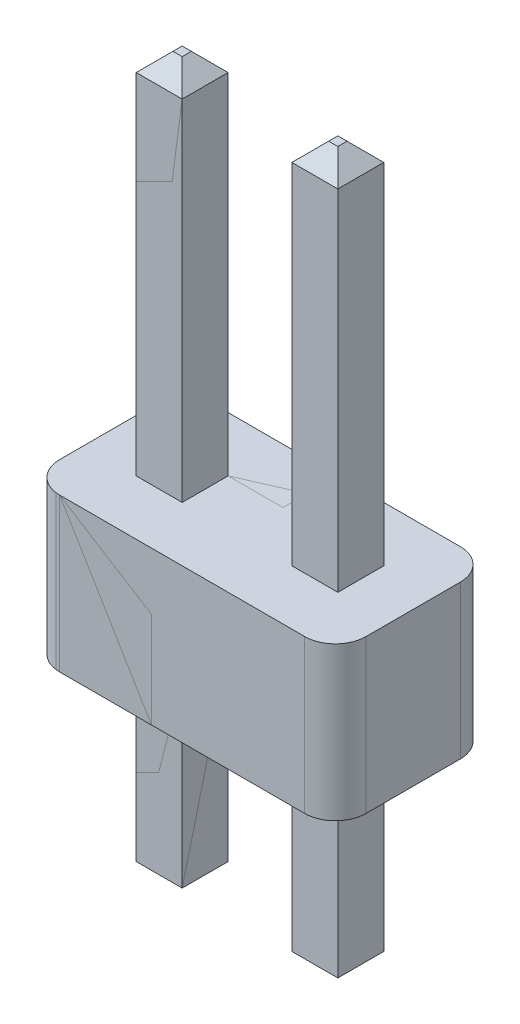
ISO-10303-21;
HEADER;
FILE_DESCRIPTION(('STEP AP214'),'2;1');
FILE_NAME('part.step','',(''),(''),'','','');
FILE_SCHEMA(('AUTOMOTIVE_DESIGN { 1 0 10303 214 1 1 1 1 }'));
ENDSEC;
DATA;
#1=APPLICATION_CONTEXT('core data for automotive mechanical design processes');
#2=APPLICATION_PROTOCOL_DEFINITION('international standard','automotive_design',2000,#1);
#3=PRODUCT_CONTEXT('',#1,'mechanical');
#4=PRODUCT('Part','Part','',(#3));
#5=PRODUCT_RELATED_PRODUCT_CATEGORY('part','',(#4));
#6=PRODUCT_DEFINITION_FORMATION('','',#4);
#7=PRODUCT_DEFINITION_CONTEXT('part definition',#1,'design');
#8=PRODUCT_DEFINITION('design','',#6,#7);
#9=PRODUCT_DEFINITION_SHAPE('','',#8);
#10=(LENGTH_UNIT() NAMED_UNIT(*) SI_UNIT(.MILLI.,.METRE.));
#11=(NAMED_UNIT(*) PLANE_ANGLE_UNIT() SI_UNIT($,.RADIAN.));
#12=(NAMED_UNIT(*) SI_UNIT($,.STERADIAN.) SOLID_ANGLE_UNIT());
#13=UNCERTAINTY_MEASURE_WITH_UNIT(LENGTH_MEASURE(1.E-05),#10,'distance_accuracy_value','');
#14=(GEOMETRIC_REPRESENTATION_CONTEXT(3) GLOBAL_UNCERTAINTY_ASSIGNED_CONTEXT((#13)) GLOBAL_UNIT_ASSIGNED_CONTEXT((#10,
#11,#12)) REPRESENTATION_CONTEXT('',''));
#15=CARTESIAN_POINT('',(0.,0.,0.));
#16=DIRECTION('',(0.,0.,1.));
#17=DIRECTION('',(1.,0.,0.));
#18=AXIS2_PLACEMENT_3D('',#15,#16,#17);
#19=CARTESIAN_POINT('',(-1.645,-2.95,-0.375));
#20=DIRECTION('',(0.,0.707106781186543,0.707106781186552));
#21=DIRECTION('',(0.,-0.707106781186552,0.707106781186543));
#22=AXIS2_PLACEMENT_3D('',#19,#20,#21);
#23=PLANE('',#22);
#24=DIRECTION('',(1.,0.,0.));
#25=VECTOR('',#24,1.);
#26=CARTESIAN_POINT('',(0.,-3.25,-0.0750000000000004));
#27=LINE('',#26,#25);
#28=CARTESIAN_POINT('',(-1.345,-3.25,-0.0750000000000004));
#29=VERTEX_POINT('',#28);
#30=CARTESIAN_POINT('',(-1.195,-3.25,-0.0750000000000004));
#31=VERTEX_POINT('',#30);
#32=EDGE_CURVE('P0_E164',#29,#31,#27,.T.);
#33=ORIENTED_EDGE('',*,*,#32,.F.);
#34=DIRECTION('',(-0.577350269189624,0.57735026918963,-0.577350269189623));
#35=VECTOR('',#34,1.);
#36=CARTESIAN_POINT('',(-1.345,-3.25,-0.0750000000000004));
#37=LINE('',#36,#35);
#38=CARTESIAN_POINT('',(-1.645,-2.95,-0.375));
#39=VERTEX_POINT('',#38);
#40=EDGE_CURVE('P0_E167',#29,#39,#37,.T.);
#41=ORIENTED_EDGE('',*,*,#40,.T.);
#42=DIRECTION('',(-1.,0.,0.));
#43=VECTOR('',#42,1.);
#44=CARTESIAN_POINT('',(-1.645,-2.95,-0.375));
#45=LINE('',#44,#43);
#46=CARTESIAN_POINT('',(-0.895,-2.95,-0.375));
#47=VERTEX_POINT('',#46);
#48=EDGE_CURVE('P0_E193',#47,#39,#45,.T.);
#49=ORIENTED_EDGE('',*,*,#48,.F.);
#50=DIRECTION('',(-0.577350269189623,-0.577350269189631,0.577350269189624));
#51=VECTOR('',#50,1.);
#52=CARTESIAN_POINT('',(-0.895,-2.95,-0.375));
#53=LINE('',#52,#51);
#54=EDGE_CURVE('P0_E170',#47,#31,#53,.T.);
#55=ORIENTED_EDGE('',*,*,#54,.T.);
#56=EDGE_LOOP('',(#33,#41,#49,#55));
#57=FACE_BOUND('',#56,.T.);
#58=ADVANCED_FACE('P0_F26',(#57),#23,.F.);
#59=CARTESIAN_POINT('',(0.,-3.25,0.));
#60=DIRECTION('',(0.,-1.,0.));
#61=DIRECTION('',(0.,0.,-1.));
#62=AXIS2_PLACEMENT_3D('',#59,#60,#61);
#63=PLANE('',#62);
#64=DIRECTION('',(0.,0.,1.));
#65=VECTOR('',#64,1.);
#66=CARTESIAN_POINT('',(-1.345,-3.25,0.375));
#67=LINE('',#66,#65);
#68=CARTESIAN_POINT('',(-1.345,-3.25,0.075));
#69=VERTEX_POINT('',#68);
#70=EDGE_CURVE('P0_E173',#69,#29,#67,.F.);
#71=ORIENTED_EDGE('',*,*,#70,.T.);
#72=ORIENTED_EDGE('',*,*,#32,.T.);
#73=DIRECTION('',(0.,0.,1.));
#74=VECTOR('',#73,1.);
#75=CARTESIAN_POINT('',(-1.195,-3.25,-0.375));
#76=LINE('',#75,#74);
#77=CARTESIAN_POINT('',(-1.195,-3.25,0.0750000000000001));
#78=VERTEX_POINT('',#77);
#79=EDGE_CURVE('P0_E188',#31,#78,#76,.T.);
#80=ORIENTED_EDGE('',*,*,#79,.T.);
#81=DIRECTION('',(1.,0.,0.));
#82=VECTOR('',#81,1.);
#83=CARTESIAN_POINT('',(-0.895,-3.25,0.075));
#84=LINE('',#83,#82);
#85=EDGE_CURVE('P0_E179',#78,#69,#84,.F.);
#86=ORIENTED_EDGE('',*,*,#85,.T.);
#87=EDGE_LOOP('',(#71,#72,#80,#86));
#88=FACE_BOUND('',#87,.T.);
#89=ADVANCED_FACE('P0_F177',(#88),#63,.T.);
#90=CARTESIAN_POINT('',(-1.645,-2.95,0.375));
#91=DIRECTION('',(0.707106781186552,0.707106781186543,0.));
#92=DIRECTION('',(-0.707106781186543,0.707106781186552,0.));
#93=AXIS2_PLACEMENT_3D('',#90,#91,#92);
#94=PLANE('',#93);
#95=ORIENTED_EDGE('',*,*,#70,.F.);
#96=DIRECTION('',(-0.577350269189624,0.57735026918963,0.577350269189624));
#97=VECTOR('',#96,1.);
#98=CARTESIAN_POINT('',(-1.345,-3.25,0.0749999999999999));
#99=LINE('',#98,#97);
#100=CARTESIAN_POINT('',(-1.645,-2.95,0.375));
#101=VERTEX_POINT('',#100);
#102=EDGE_CURVE('P0_E205',#69,#101,#99,.T.);
#103=ORIENTED_EDGE('',*,*,#102,.T.);
#104=DIRECTION('',(0.,0.,1.));
#105=VECTOR('',#104,1.);
#106=CARTESIAN_POINT('',(-1.645,-2.95,0.375));
#107=LINE('',#106,#105);
#108=EDGE_CURVE('P0_E186',#39,#101,#107,.T.);
#109=ORIENTED_EDGE('',*,*,#108,.F.);
#110=ORIENTED_EDGE('',*,*,#40,.F.);
#111=EDGE_LOOP('',(#95,#103,#109,#110));
#112=FACE_BOUND('',#111,.T.);
#113=ADVANCED_FACE('P0_F184',(#112),#94,.F.);
#114=CARTESIAN_POINT('',(-0.895,-2.95,-0.375));
#115=DIRECTION('',(-0.707106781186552,0.707106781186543,0.));
#116=DIRECTION('',(-0.707106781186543,-0.707106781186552,0.));
#117=AXIS2_PLACEMENT_3D('',#114,#115,#116);
#118=PLANE('',#117);
#119=DIRECTION('',(0.,0.,-1.));
#120=VECTOR('',#119,1.);
#121=CARTESIAN_POINT('',(-0.895,-2.95,-0.375));
#122=LINE('',#121,#120);
#123=CARTESIAN_POINT('',(-0.895,-2.95,0.375));
#124=VERTEX_POINT('',#123);
#125=EDGE_CURVE('P0_E207',#124,#47,#122,.T.);
#126=ORIENTED_EDGE('',*,*,#125,.F.);
#127=DIRECTION('',(-0.577350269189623,-0.57735026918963,-0.577350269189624));
#128=VECTOR('',#127,1.);
#129=CARTESIAN_POINT('',(-0.895,-2.95,0.375));
#130=LINE('',#129,#128);
#131=EDGE_CURVE('P0_E202',#124,#78,#130,.T.);
#132=ORIENTED_EDGE('',*,*,#131,.T.);
#133=ORIENTED_EDGE('',*,*,#79,.F.);
#134=ORIENTED_EDGE('',*,*,#54,.F.);
#135=EDGE_LOOP('',(#126,#132,#133,#134));
#136=FACE_BOUND('',#135,.T.);
#137=ADVANCED_FACE('P0_F500',(#136),#118,.F.);
#138=CARTESIAN_POINT('',(-1.645,-3.25,-0.375));
#139=DIRECTION('',(0.,0.,-1.));
#140=DIRECTION('',(-1.,0.,0.));
#141=AXIS2_PLACEMENT_3D('',#138,#139,#140);
#142=PLANE('',#141);
#143=DIRECTION('',(0.,1.,0.));
#144=VECTOR('',#143,1.);
#145=CARTESIAN_POINT('',(-1.645,-3.25,-0.375));
#146=LINE('',#145,#144);
#147=CARTESIAN_POINT('',(-1.645,0.,-0.375));
#148=VERTEX_POINT('',#147);
#149=EDGE_CURVE('P0_E197',#148,#39,#146,.F.);
#150=ORIENTED_EDGE('',*,*,#149,.F.);
#151=DIRECTION('',(-1.,0.,0.));
#152=VECTOR('',#151,1.);
#153=CARTESIAN_POINT('',(-1.645,0.,-0.375));
#154=LINE('',#153,#152);
#155=CARTESIAN_POINT('',(-0.895,0.,-0.375));
#156=VERTEX_POINT('',#155);
#157=EDGE_CURVE('P0_E195',#148,#156,#154,.F.);
#158=ORIENTED_EDGE('',*,*,#157,.T.);
#159=DIRECTION('',(0.,1.,0.));
#160=VECTOR('',#159,1.);
#161=CARTESIAN_POINT('',(-0.895,-3.25,-0.375));
#162=LINE('',#161,#160);
#163=EDGE_CURVE('P0_E214',#47,#156,#162,.T.);
#164=ORIENTED_EDGE('',*,*,#163,.F.);
#165=ORIENTED_EDGE('',*,*,#48,.T.);
#166=EDGE_LOOP('',(#150,#158,#164,#165));
#167=FACE_BOUND('',#166,.T.);
#168=ADVANCED_FACE('P0_F493',(#167),#142,.T.);
#169=CARTESIAN_POINT('',(0.,8.5,0.075));
#170=DIRECTION('',(0.,0.707106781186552,0.707106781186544));
#171=DIRECTION('',(0.,-0.707106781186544,0.707106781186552));
#172=AXIS2_PLACEMENT_3D('',#169,#170,#171);
#173=PLANE('',#172);
#174=DIRECTION('',(0.577350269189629,0.577350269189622,-0.577350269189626));
#175=VECTOR('',#174,1.);
#176=CARTESIAN_POINT('',(-1.645,8.2,0.375));
#177=LINE('',#176,#175);
#178=CARTESIAN_POINT('',(-1.645,8.2,0.375000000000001));
#179=VERTEX_POINT('',#178);
#180=CARTESIAN_POINT('',(-1.345,8.5,0.0750000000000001));
#181=VERTEX_POINT('',#180);
#182=EDGE_CURVE('P0_E213',#179,#181,#177,.T.);
#183=ORIENTED_EDGE('',*,*,#182,.F.);
#184=DIRECTION('',(1.,0.,0.));
#185=VECTOR('',#184,1.);
#186=CARTESIAN_POINT('',(-0.895,8.2,0.375));
#187=LINE('',#186,#185);
#188=CARTESIAN_POINT('',(-0.895,8.2,0.375000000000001));
#189=VERTEX_POINT('',#188);
#190=EDGE_CURVE('P0_E229',#189,#179,#187,.F.);
#191=ORIENTED_EDGE('',*,*,#190,.F.);
#192=DIRECTION('',(0.577350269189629,-0.577350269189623,0.577350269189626));
#193=VECTOR('',#192,1.);
#194=CARTESIAN_POINT('',(-1.195,8.5,0.075));
#195=LINE('',#194,#193);
#196=CARTESIAN_POINT('',(-1.195,8.5,0.075));
#197=VERTEX_POINT('',#196);
#198=EDGE_CURVE('P0_E224',#197,#189,#195,.T.);
#199=ORIENTED_EDGE('',*,*,#198,.F.);
#200=DIRECTION('',(1.,0.,0.));
#201=VECTOR('',#200,1.);
#202=CARTESIAN_POINT('',(0.,8.5,0.075));
#203=LINE('',#202,#201);
#204=EDGE_CURVE('P0_E221',#197,#181,#203,.F.);
#205=ORIENTED_EDGE('',*,*,#204,.T.);
#206=EDGE_LOOP('',(#183,#191,#199,#205));
#207=FACE_BOUND('',#206,.T.);
#208=ADVANCED_FACE('P0_F419',(#207),#173,.T.);
#209=CARTESIAN_POINT('',(-1.645,-3.25,0.375));
#210=DIRECTION('',(-1.,0.,0.));
#211=DIRECTION('',(0.,0.,1.));
#212=AXIS2_PLACEMENT_3D('',#209,#210,#211);
#213=PLANE('',#212);
#214=DIRECTION('',(0.,1.,0.));
#215=VECTOR('',#214,1.);
#216=CARTESIAN_POINT('',(-1.645,-3.25,0.375));
#217=LINE('',#216,#215);
#218=CARTESIAN_POINT('',(-1.645,0.,0.375));
#219=VERTEX_POINT('',#218);
#220=EDGE_CURVE('P0_E244',#219,#101,#217,.F.);
#221=ORIENTED_EDGE('',*,*,#220,.F.);
#222=DIRECTION('',(0.,0.,1.));
#223=VECTOR('',#222,1.);
#224=CARTESIAN_POINT('',(-1.645,0.,0.375));
#225=LINE('',#224,#223);
#226=EDGE_CURVE('P0_E199',#219,#148,#225,.F.);
#227=ORIENTED_EDGE('',*,*,#226,.T.);
#228=ORIENTED_EDGE('',*,*,#149,.T.);
#229=ORIENTED_EDGE('',*,*,#108,.T.);
#230=EDGE_LOOP('',(#221,#227,#228,#229));
#231=FACE_BOUND('',#230,.T.);
#232=ADVANCED_FACE('P0_F478',(#231),#213,.T.);
#233=CARTESIAN_POINT('',(-0.895,-2.95,0.375));
#234=DIRECTION('',(0.,0.707106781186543,-0.707106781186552));
#235=DIRECTION('',(0.,0.707106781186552,0.707106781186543));
#236=AXIS2_PLACEMENT_3D('',#233,#234,#235);
#237=PLANE('',#236);
#238=ORIENTED_EDGE('',*,*,#85,.F.);
#239=ORIENTED_EDGE('',*,*,#131,.F.);
#240=DIRECTION('',(1.,0.,0.));
#241=VECTOR('',#240,1.);
#242=CARTESIAN_POINT('',(-0.895,-2.95,0.375));
#243=LINE('',#242,#241);
#244=EDGE_CURVE('P0_E241',#101,#124,#243,.T.);
#245=ORIENTED_EDGE('',*,*,#244,.F.);
#246=ORIENTED_EDGE('',*,*,#102,.F.);
#247=EDGE_LOOP('',(#238,#239,#245,#246));
#248=FACE_BOUND('',#247,.T.);
#249=ADVANCED_FACE('P0_F471',(#248),#237,.F.);
#250=CARTESIAN_POINT('',(-0.895,-3.25,-0.375));
#251=DIRECTION('',(1.,0.,0.));
#252=DIRECTION('',(0.,0.,-1.));
#253=AXIS2_PLACEMENT_3D('',#250,#251,#252);
#254=PLANE('',#253);
#255=ORIENTED_EDGE('',*,*,#163,.T.);
#256=DIRECTION('',(0.,0.,-1.));
#257=VECTOR('',#256,1.);
#258=CARTESIAN_POINT('',(-0.895,0.,-0.375));
#259=LINE('',#258,#257);
#260=CARTESIAN_POINT('',(-0.895,0.,0.375));
#261=VERTEX_POINT('',#260);
#262=EDGE_CURVE('P0_E211',#156,#261,#259,.F.);
#263=ORIENTED_EDGE('',*,*,#262,.T.);
#264=DIRECTION('',(0.,1.,0.));
#265=VECTOR('',#264,1.);
#266=CARTESIAN_POINT('',(-0.895,-3.25,0.375));
#267=LINE('',#266,#265);
#268=EDGE_CURVE('P0_E237',#124,#261,#267,.T.);
#269=ORIENTED_EDGE('',*,*,#268,.F.);
#270=ORIENTED_EDGE('',*,*,#125,.T.);
#271=EDGE_LOOP('',(#255,#263,#269,#270));
#272=FACE_BOUND('',#271,.T.);
#273=ADVANCED_FACE('P0_F435',(#272),#254,.T.);
#274=CARTESIAN_POINT('',(-1.345,8.5,0.));
#275=DIRECTION('',(-0.707106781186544,0.707106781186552,0.));
#276=DIRECTION('',(-0.707106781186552,-0.707106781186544,0.));
#277=AXIS2_PLACEMENT_3D('',#274,#275,#276);
#278=PLANE('',#277);
#279=ORIENTED_EDGE('',*,*,#182,.T.);
#280=DIRECTION('',(0.,0.,-1.));
#281=VECTOR('',#280,1.);
#282=CARTESIAN_POINT('',(-1.345,8.5,0.));
#283=LINE('',#282,#281);
#284=CARTESIAN_POINT('',(-1.345,8.5,-0.0750000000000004));
#285=VERTEX_POINT('',#284);
#286=EDGE_CURVE('P0_E222',#181,#285,#283,.T.);
#287=ORIENTED_EDGE('',*,*,#286,.T.);
#288=DIRECTION('',(0.577350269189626,0.577350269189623,0.577350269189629));
#289=VECTOR('',#288,1.);
#290=CARTESIAN_POINT('',(-1.645,8.2,-0.375000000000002));
#291=LINE('',#290,#289);
#292=CARTESIAN_POINT('',(-1.645,8.2,-0.375));
#293=VERTEX_POINT('',#292);
#294=EDGE_CURVE('P0_E261',#293,#285,#291,.T.);
#295=ORIENTED_EDGE('',*,*,#294,.F.);
#296=DIRECTION('',(0.,0.,1.));
#297=VECTOR('',#296,1.);
#298=CARTESIAN_POINT('',(-1.645,8.2,0.375));
#299=LINE('',#298,#297);
#300=EDGE_CURVE('P0_E252',#179,#293,#299,.F.);
#301=ORIENTED_EDGE('',*,*,#300,.F.);
#302=EDGE_LOOP('',(#279,#287,#295,#301));
#303=FACE_BOUND('',#302,.T.);
#304=ADVANCED_FACE('P0_F422',(#303),#278,.T.);
#305=CARTESIAN_POINT('',(0.,8.5,0.));
#306=DIRECTION('',(0.,-1.,0.));
#307=DIRECTION('',(0.,0.,-1.));
#308=AXIS2_PLACEMENT_3D('',#305,#306,#307);
#309=PLANE('',#308);
#310=ORIENTED_EDGE('',*,*,#286,.F.);
#311=ORIENTED_EDGE('',*,*,#204,.F.);
#312=DIRECTION('',(0.,0.,1.));
#313=VECTOR('',#312,1.);
#314=CARTESIAN_POINT('',(-1.195,8.5,0.));
#315=LINE('',#314,#313);
#316=CARTESIAN_POINT('',(-1.195,8.5,-0.0750000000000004));
#317=VERTEX_POINT('',#316);
#318=EDGE_CURVE('P0_E226',#317,#197,#315,.T.);
#319=ORIENTED_EDGE('',*,*,#318,.F.);
#320=DIRECTION('',(1.,0.,0.));
#321=VECTOR('',#320,1.);
#322=CARTESIAN_POINT('',(0.,8.5,-0.0750000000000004));
#323=LINE('',#322,#321);
#324=EDGE_CURVE('P0_E257',#285,#317,#323,.T.);
#325=ORIENTED_EDGE('',*,*,#324,.F.);
#326=EDGE_LOOP('',(#310,#311,#319,#325));
#327=FACE_BOUND('',#326,.T.);
#328=ADVANCED_FACE('P0_F424',(#327),#309,.F.);
#329=CARTESIAN_POINT('',(-1.195,8.5,0.));
#330=DIRECTION('',(0.707106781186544,0.707106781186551,0.));
#331=DIRECTION('',(-0.707106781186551,0.707106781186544,0.));
#332=AXIS2_PLACEMENT_3D('',#329,#330,#331);
#333=PLANE('',#332);
#334=DIRECTION('',(0.577350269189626,-0.577350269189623,-0.577350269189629));
#335=VECTOR('',#334,1.);
#336=CARTESIAN_POINT('',(-1.195,8.5,-0.0750000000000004));
#337=LINE('',#336,#335);
#338=CARTESIAN_POINT('',(-0.894999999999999,8.2,-0.375000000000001));
#339=VERTEX_POINT('',#338);
#340=EDGE_CURVE('P0_E251',#317,#339,#337,.T.);
#341=ORIENTED_EDGE('',*,*,#340,.F.);
#342=ORIENTED_EDGE('',*,*,#318,.T.);
#343=ORIENTED_EDGE('',*,*,#198,.T.);
#344=DIRECTION('',(0.,0.,-1.));
#345=VECTOR('',#344,1.);
#346=CARTESIAN_POINT('',(-0.895,8.2,-0.375));
#347=LINE('',#346,#345);
#348=EDGE_CURVE('P0_E260',#339,#189,#347,.F.);
#349=ORIENTED_EDGE('',*,*,#348,.F.);
#350=EDGE_LOOP('',(#341,#342,#343,#349));
#351=FACE_BOUND('',#350,.T.);
#352=ADVANCED_FACE('P0_F414',(#351),#333,.T.);
#353=CARTESIAN_POINT('',(-0.895,-3.25,0.375));
#354=DIRECTION('',(0.,0.,1.));
#355=DIRECTION('',(1.,0.,0.));
#356=AXIS2_PLACEMENT_3D('',#353,#354,#355);
#357=PLANE('',#356);
#358=DIRECTION('',(0.,1.,0.));
#359=VECTOR('',#358,1.);
#360=CARTESIAN_POINT('',(-1.645,-3.25,0.375));
#361=LINE('',#360,#359);
#362=CARTESIAN_POINT('',(-1.645,2.5,0.375));
#363=VERTEX_POINT('',#362);
#364=EDGE_CURVE('P0_E240',#363,#179,#361,.T.);
#365=ORIENTED_EDGE('',*,*,#364,.F.);
#366=DIRECTION('',(1.,0.,0.));
#367=VECTOR('',#366,1.);
#368=CARTESIAN_POINT('',(-0.895,2.5,0.375));
#369=LINE('',#368,#367);
#370=CARTESIAN_POINT('',(-0.895,2.5,0.375));
#371=VERTEX_POINT('',#370);
#372=EDGE_CURVE('P0_E232',#363,#371,#369,.T.);
#373=ORIENTED_EDGE('',*,*,#372,.T.);
#374=DIRECTION('',(0.,1.,0.));
#375=VECTOR('',#374,1.);
#376=CARTESIAN_POINT('',(-0.895,-3.25,0.375));
#377=LINE('',#376,#375);
#378=EDGE_CURVE('P0_E269',#189,#371,#377,.F.);
#379=ORIENTED_EDGE('',*,*,#378,.F.);
#380=ORIENTED_EDGE('',*,*,#190,.T.);
#381=EDGE_LOOP('',(#365,#373,#379,#380));
#382=FACE_BOUND('',#381,.T.);
#383=ADVANCED_FACE('P0_F417',(#382),#357,.T.);
#384=CARTESIAN_POINT('',(-2.5,2.5,0.77));
#385=DIRECTION('',(1.,0.,0.));
#386=DIRECTION('',(0.,0.,-1.));
#387=AXIS2_PLACEMENT_3D('',#384,#385,#386);
#388=PLANE('',#387);
#389=DIRECTION('',(0.,-1.,0.));
#390=VECTOR('',#389,1.);
#391=CARTESIAN_POINT('',(-2.5,2.5,0.77));
#392=LINE('',#391,#390);
#393=CARTESIAN_POINT('',(-2.5,2.5,0.77));
#394=VERTEX_POINT('',#393);
#395=CARTESIAN_POINT('',(-2.5,0.,0.77));
#396=VERTEX_POINT('',#395);
#397=EDGE_CURVE('P0_E278',#394,#396,#392,.T.);
#398=ORIENTED_EDGE('',*,*,#397,.F.);
#399=DIRECTION('',(0.,0.,-1.));
#400=VECTOR('',#399,1.);
#401=CARTESIAN_POINT('',(-2.5,2.5,0.77));
#402=LINE('',#401,#400);
#403=CARTESIAN_POINT('',(-2.5,2.5,-0.77));
#404=VERTEX_POINT('',#403);
#405=EDGE_CURVE('P0_E234',#404,#394,#402,.F.);
#406=ORIENTED_EDGE('',*,*,#405,.F.);
#407=DIRECTION('',(0.,-1.,0.));
#408=VECTOR('',#407,1.);
#409=CARTESIAN_POINT('',(-2.5,2.5,-0.77));
#410=LINE('',#409,#408);
#411=CARTESIAN_POINT('',(-2.5,0.,-0.77));
#412=VERTEX_POINT('',#411);
#413=EDGE_CURVE('P0_E268',#412,#404,#410,.F.);
#414=ORIENTED_EDGE('',*,*,#413,.F.);
#415=DIRECTION('',(0.,0.,-1.));
#416=VECTOR('',#415,1.);
#417=CARTESIAN_POINT('',(-2.5,0.,0.77));
#418=LINE('',#417,#416);
#419=EDGE_CURVE('P0_E247',#396,#412,#418,.T.);
#420=ORIENTED_EDGE('',*,*,#419,.F.);
#421=EDGE_LOOP('',(#398,#406,#414,#420));
#422=FACE_BOUND('',#421,.T.);
#423=ADVANCED_FACE('P0_F366',(#422),#388,.F.);
#424=CARTESIAN_POINT('',(-0.895,-3.25,0.375));
#425=DIRECTION('',(0.,0.,1.));
#426=DIRECTION('',(1.,0.,0.));
#427=AXIS2_PLACEMENT_3D('',#424,#425,#426);
#428=PLANE('',#427);
#429=ORIENTED_EDGE('',*,*,#268,.T.);
#430=DIRECTION('',(1.,0.,0.));
#431=VECTOR('',#430,1.);
#432=CARTESIAN_POINT('',(2.,0.,0.375));
#433=LINE('',#432,#431);
#434=EDGE_CURVE('P0_E274',#261,#219,#433,.F.);
#435=ORIENTED_EDGE('',*,*,#434,.T.);
#436=ORIENTED_EDGE('',*,*,#220,.T.);
#437=ORIENTED_EDGE('',*,*,#244,.T.);
#438=EDGE_LOOP('',(#429,#435,#436,#437));
#439=FACE_BOUND('',#438,.T.);
#440=ADVANCED_FACE('P0_F441',(#439),#428,.T.);
#441=CARTESIAN_POINT('',(-1.645,-3.25,0.375));
#442=DIRECTION('',(-1.,0.,0.));
#443=DIRECTION('',(0.,0.,1.));
#444=AXIS2_PLACEMENT_3D('',#441,#442,#443);
#445=PLANE('',#444);
#446=DIRECTION('',(0.,1.,0.));
#447=VECTOR('',#446,1.);
#448=CARTESIAN_POINT('',(-1.645,-3.25,-0.375));
#449=LINE('',#448,#447);
#450=CARTESIAN_POINT('',(-1.645,2.5,-0.375));
#451=VERTEX_POINT('',#450);
#452=EDGE_CURVE('P0_E286',#451,#293,#449,.T.);
#453=ORIENTED_EDGE('',*,*,#452,.F.);
#454=DIRECTION('',(0.,0.,1.));
#455=VECTOR('',#454,1.);
#456=CARTESIAN_POINT('',(-1.645,2.5,0.375));
#457=LINE('',#456,#455);
#458=EDGE_CURVE('P0_E248',#451,#363,#457,.T.);
#459=ORIENTED_EDGE('',*,*,#458,.T.);
#460=ORIENTED_EDGE('',*,*,#364,.T.);
#461=ORIENTED_EDGE('',*,*,#300,.T.);
#462=EDGE_LOOP('',(#453,#459,#460,#461));
#463=FACE_BOUND('',#462,.T.);
#464=ADVANCED_FACE('P0_F406',(#463),#445,.T.);
#465=CARTESIAN_POINT('',(0.,8.5,-0.0750000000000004));
#466=DIRECTION('',(0.,0.707106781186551,-0.707106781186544));
#467=DIRECTION('',(0.,0.707106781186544,0.707106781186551));
#468=AXIS2_PLACEMENT_3D('',#465,#466,#467);
#469=PLANE('',#468);
#470=ORIENTED_EDGE('',*,*,#294,.T.);
#471=ORIENTED_EDGE('',*,*,#324,.T.);
#472=ORIENTED_EDGE('',*,*,#340,.T.);
#473=DIRECTION('',(-1.,0.,0.));
#474=VECTOR('',#473,1.);
#475=CARTESIAN_POINT('',(-1.645,8.2,-0.375));
#476=LINE('',#475,#474);
#477=EDGE_CURVE('P0_E283',#293,#339,#476,.F.);
#478=ORIENTED_EDGE('',*,*,#477,.F.);
#479=EDGE_LOOP('',(#470,#471,#472,#478));
#480=FACE_BOUND('',#479,.T.);
#481=ADVANCED_FACE('P0_F410',(#480),#469,.T.);
#482=CARTESIAN_POINT('',(-0.895,-3.25,-0.375));
#483=DIRECTION('',(1.,0.,0.));
#484=DIRECTION('',(0.,0.,-1.));
#485=AXIS2_PLACEMENT_3D('',#482,#483,#484);
#486=PLANE('',#485);
#487=ORIENTED_EDGE('',*,*,#378,.T.);
#488=DIRECTION('',(0.,0.,-1.));
#489=VECTOR('',#488,1.);
#490=CARTESIAN_POINT('',(-0.895,2.5,-0.375));
#491=LINE('',#490,#489);
#492=CARTESIAN_POINT('',(-0.895,2.5,-0.375));
#493=VERTEX_POINT('',#492);
#494=EDGE_CURVE('P0_E266',#371,#493,#491,.T.);
#495=ORIENTED_EDGE('',*,*,#494,.T.);
#496=DIRECTION('',(0.,1.,0.));
#497=VECTOR('',#496,1.);
#498=CARTESIAN_POINT('',(-0.895,-3.25,-0.375));
#499=LINE('',#498,#497);
#500=EDGE_CURVE('P0_E279',#339,#493,#499,.F.);
#501=ORIENTED_EDGE('',*,*,#500,.F.);
#502=ORIENTED_EDGE('',*,*,#348,.T.);
#503=EDGE_LOOP('',(#487,#495,#501,#502));
#504=FACE_BOUND('',#503,.T.);
#505=ADVANCED_FACE('P0_F379',(#504),#486,.T.);
#506=CARTESIAN_POINT('',(-2.,2.5,-0.77));
#507=DIRECTION('',(0.,-1.,0.));
#508=DIRECTION('',(0.,0.,-1.));
#509=AXIS2_PLACEMENT_3D('',#506,#507,#508);
#510=CYLINDRICAL_SURFACE('',#509,0.5);
#511=CARTESIAN_POINT('',(-2.,2.5,-0.77));
#512=DIRECTION('',(0.,-1.,0.));
#513=DIRECTION('',(0.,0.,-1.));
#514=AXIS2_PLACEMENT_3D('',#511,#512,#513);
#515=CIRCLE('',#514,0.5);
#516=CARTESIAN_POINT('',(-2.,2.5,-1.27));
#517=VERTEX_POINT('',#516);
#518=EDGE_CURVE('P0_E313',#404,#517,#515,.T.);
#519=ORIENTED_EDGE('',*,*,#518,.T.);
#520=DIRECTION('',(0.,1.,0.));
#521=VECTOR('',#520,1.);
#522=CARTESIAN_POINT('',(-2.,2.5,-1.27));
#523=LINE('',#522,#521);
#524=CARTESIAN_POINT('',(-2.,0.,-1.27));
#525=VERTEX_POINT('',#524);
#526=EDGE_CURVE('P0_E282',#517,#525,#523,.F.);
#527=ORIENTED_EDGE('',*,*,#526,.T.);
#528=CARTESIAN_POINT('',(-2.,0.,-0.77));
#529=DIRECTION('',(0.,-1.,0.));
#530=DIRECTION('',(0.,0.,-1.));
#531=AXIS2_PLACEMENT_3D('',#528,#529,#530);
#532=CIRCLE('',#531,0.5);
#533=EDGE_CURVE('P0_E277',#525,#412,#532,.F.);
#534=ORIENTED_EDGE('',*,*,#533,.T.);
#535=ORIENTED_EDGE('',*,*,#413,.T.);
#536=EDGE_LOOP('',(#519,#527,#534,#535));
#537=FACE_BOUND('',#536,.T.);
#538=ADVANCED_FACE('P0_F362',(#537),#510,.T.);
#539=CARTESIAN_POINT('',(-2.,2.5,0.77));
#540=DIRECTION('',(0.,-1.,0.));
#541=DIRECTION('',(0.,0.,-1.));
#542=AXIS2_PLACEMENT_3D('',#539,#540,#541);
#543=CYLINDRICAL_SURFACE('',#542,0.5);
#544=CARTESIAN_POINT('',(-2.,2.5,0.77));
#545=DIRECTION('',(0.,-1.,0.));
#546=DIRECTION('',(0.,0.,-1.));
#547=AXIS2_PLACEMENT_3D('',#544,#545,#546);
#548=CIRCLE('',#547,0.5);
#549=CARTESIAN_POINT('',(-2.,2.5,1.27));
#550=VERTEX_POINT('',#549);
#551=EDGE_CURVE('P0_E310',#550,#394,#548,.T.);
#552=ORIENTED_EDGE('',*,*,#551,.T.);
#553=ORIENTED_EDGE('',*,*,#397,.T.);
#554=CARTESIAN_POINT('',(-2.,0.,0.77));
#555=DIRECTION('',(0.,-1.,0.));
#556=DIRECTION('',(0.,0.,-1.));
#557=AXIS2_PLACEMENT_3D('',#554,#555,#556);
#558=CIRCLE('',#557,0.5);
#559=CARTESIAN_POINT('',(-2.,0.,1.27));
#560=VERTEX_POINT('',#559);
#561=EDGE_CURVE('P0_E289',#396,#560,#558,.F.);
#562=ORIENTED_EDGE('',*,*,#561,.T.);
#563=DIRECTION('',(0.,1.,0.));
#564=VECTOR('',#563,1.);
#565=CARTESIAN_POINT('',(-2.,2.5,1.27));
#566=LINE('',#565,#564);
#567=EDGE_CURVE('P0_E300',#560,#550,#566,.T.);
#568=ORIENTED_EDGE('',*,*,#567,.T.);
#569=EDGE_LOOP('',(#552,#553,#562,#568));
#570=FACE_BOUND('',#569,.T.);
#571=ADVANCED_FACE('P0_F368',(#570),#543,.T.);
#572=CARTESIAN_POINT('',(2.,0.,0.77));
#573=DIRECTION('',(0.,1.,0.));
#574=DIRECTION('',(0.,0.,1.));
#575=AXIS2_PLACEMENT_3D('',#572,#573,#574);
#576=PLANE('',#575);
#577=DIRECTION('',(0.,0.,1.));
#578=VECTOR('',#577,1.);
#579=CARTESIAN_POINT('',(0.,0.,0.77));
#580=LINE('',#579,#578);
#581=CARTESIAN_POINT('',(0.,0.,-0.77));
#582=VERTEX_POINT('',#581);
#583=CARTESIAN_POINT('',(0.,0.,0.77));
#584=VERTEX_POINT('',#583);
#585=EDGE_CURVE('P0_E174',#582,#584,#580,.T.);
#586=ORIENTED_EDGE('',*,*,#585,.T.);
#587=CARTESIAN_POINT('',(-0.5,0.,0.77));
#588=DIRECTION('',(0.,1.,0.));
#589=DIRECTION('',(0.,0.,1.));
#590=AXIS2_PLACEMENT_3D('',#587,#588,#589);
#591=CIRCLE('',#590,0.5);
#592=CARTESIAN_POINT('',(-0.5,0.,1.27));
#593=VERTEX_POINT('',#592);
#594=EDGE_CURVE('P0_E34',#584,#593,#591,.F.);
#595=ORIENTED_EDGE('',*,*,#594,.T.);
#596=DIRECTION('',(-1.,0.,0.));
#597=VECTOR('',#596,1.);
#598=CARTESIAN_POINT('',(2.,0.,1.27));
#599=LINE('',#598,#597);
#600=EDGE_CURVE('P0_E299',#593,#560,#599,.T.);
#601=ORIENTED_EDGE('',*,*,#600,.T.);
#602=ORIENTED_EDGE('',*,*,#561,.F.);
#603=ORIENTED_EDGE('',*,*,#419,.T.);
#604=ORIENTED_EDGE('',*,*,#533,.F.);
#605=DIRECTION('',(1.,0.,0.));
#606=VECTOR('',#605,1.);
#607=CARTESIAN_POINT('',(-2.,0.,-1.27));
#608=LINE('',#607,#606);
#609=CARTESIAN_POINT('',(-0.5,0.,-1.27));
#610=VERTEX_POINT('',#609);
#611=EDGE_CURVE('P0_E303',#525,#610,#608,.T.);
#612=ORIENTED_EDGE('',*,*,#611,.T.);
#613=CARTESIAN_POINT('',(-0.5,0.,-0.77));
#614=DIRECTION('',(0.,1.,0.));
#615=DIRECTION('',(0.,0.,1.));
#616=AXIS2_PLACEMENT_3D('',#613,#614,#615);
#617=CIRCLE('',#616,0.5);
#618=EDGE_CURVE('P0_E41',#610,#582,#617,.F.);
#619=ORIENTED_EDGE('',*,*,#618,.T.);
#620=EDGE_LOOP('',(#586,#595,#601,#602,#603,#604,#612,#619));
#621=FACE_BOUND('',#620,.T.);
#622=ORIENTED_EDGE('',*,*,#262,.F.);
#623=ORIENTED_EDGE('',*,*,#157,.F.);
#624=ORIENTED_EDGE('',*,*,#226,.F.);
#625=ORIENTED_EDGE('',*,*,#434,.F.);
#626=EDGE_LOOP('',(#622,#623,#624,#625));
#627=FACE_BOUND('',#626,.T.);
#628=ADVANCED_FACE('P0_F338',(#621,#627),#576,.F.);
#629=CARTESIAN_POINT('',(-1.645,-3.25,-0.375));
#630=DIRECTION('',(0.,0.,-1.));
#631=DIRECTION('',(-1.,0.,0.));
#632=AXIS2_PLACEMENT_3D('',#629,#630,#631);
#633=PLANE('',#632);
#634=ORIENTED_EDGE('',*,*,#500,.T.);
#635=DIRECTION('',(1.,0.,0.));
#636=VECTOR('',#635,1.);
#637=CARTESIAN_POINT('',(2.,2.5,-0.375));
#638=LINE('',#637,#636);
#639=EDGE_CURVE('P0_E296',#451,#493,#638,.T.);
#640=ORIENTED_EDGE('',*,*,#639,.F.);
#641=ORIENTED_EDGE('',*,*,#452,.T.);
#642=ORIENTED_EDGE('',*,*,#477,.T.);
#643=EDGE_LOOP('',(#634,#640,#641,#642));
#644=FACE_BOUND('',#643,.T.);
#645=ADVANCED_FACE('P0_F377',(#644),#633,.T.);
#646=CARTESIAN_POINT('',(-2.,2.5,-1.27));
#647=DIRECTION('',(0.,0.,1.));
#648=DIRECTION('',(1.,0.,0.));
#649=AXIS2_PLACEMENT_3D('',#646,#647,#648);
#650=PLANE('',#649);
#651=DIRECTION('',(1.,0.,0.));
#652=VECTOR('',#651,1.);
#653=CARTESIAN_POINT('',(2.,2.5,-1.27));
#654=LINE('',#653,#652);
#655=CARTESIAN_POINT('',(-0.5,2.5,-1.27));
#656=VERTEX_POINT('',#655);
#657=EDGE_CURVE('P0_E294',#656,#517,#654,.F.);
#658=ORIENTED_EDGE('',*,*,#657,.F.);
#659=DIRECTION('',(0.,-1.,0.));
#660=VECTOR('',#659,1.);
#661=CARTESIAN_POINT('',(-0.5,2.5,-1.27));
#662=LINE('',#661,#660);
#663=EDGE_CURVE('P0_E11',#656,#610,#662,.T.);
#664=ORIENTED_EDGE('',*,*,#663,.T.);
#665=ORIENTED_EDGE('',*,*,#611,.F.);
#666=ORIENTED_EDGE('',*,*,#526,.F.);
#667=EDGE_LOOP('',(#658,#664,#665,#666));
#668=FACE_BOUND('',#667,.T.);
#669=ADVANCED_FACE('P0_F358',(#668),#650,.F.);
#670=CARTESIAN_POINT('',(2.,2.5,1.27));
#671=DIRECTION('',(0.,0.,-1.));
#672=DIRECTION('',(-1.,0.,0.));
#673=AXIS2_PLACEMENT_3D('',#670,#671,#672);
#674=PLANE('',#673);
#675=ORIENTED_EDGE('',*,*,#600,.F.);
#676=DIRECTION('',(0.,1.,0.));
#677=VECTOR('',#676,1.);
#678=CARTESIAN_POINT('',(-0.5,2.5,1.27));
#679=LINE('',#678,#677);
#680=CARTESIAN_POINT('',(-0.5,2.5,1.27));
#681=VERTEX_POINT('',#680);
#682=EDGE_CURVE('P0_E325',#593,#681,#679,.T.);
#683=ORIENTED_EDGE('',*,*,#682,.T.);
#684=DIRECTION('',(1.,0.,0.));
#685=VECTOR('',#684,1.);
#686=CARTESIAN_POINT('',(2.,2.5,1.27));
#687=LINE('',#686,#685);
#688=EDGE_CURVE('P0_E290',#550,#681,#687,.T.);
#689=ORIENTED_EDGE('',*,*,#688,.F.);
#690=ORIENTED_EDGE('',*,*,#567,.F.);
#691=EDGE_LOOP('',(#675,#683,#689,#690));
#692=FACE_BOUND('',#691,.T.);
#693=ADVANCED_FACE('P0_F345',(#692),#674,.F.);
#694=CARTESIAN_POINT('',(2.,2.5,0.77));
#695=DIRECTION('',(0.,1.,0.));
#696=DIRECTION('',(0.,0.,1.));
#697=AXIS2_PLACEMENT_3D('',#694,#695,#696);
#698=PLANE('',#697);
#699=ORIENTED_EDGE('',*,*,#688,.T.);
#700=CARTESIAN_POINT('',(-0.5,2.5,0.77));
#701=DIRECTION('',(0.,1.,0.));
#702=DIRECTION('',(0.,0.,1.));
#703=AXIS2_PLACEMENT_3D('',#700,#701,#702);
#704=CIRCLE('',#703,0.5);
#705=CARTESIAN_POINT('',(0.,2.5,0.77));
#706=VERTEX_POINT('',#705);
#707=EDGE_CURVE('P0_E330',#681,#706,#704,.T.);
#708=ORIENTED_EDGE('',*,*,#707,.T.);
#709=DIRECTION('',(0.,0.,1.));
#710=VECTOR('',#709,1.);
#711=CARTESIAN_POINT('',(0.,2.5,0.77));
#712=LINE('',#711,#710);
#713=CARTESIAN_POINT('',(0.,2.5,-0.77));
#714=VERTEX_POINT('',#713);
#715=EDGE_CURVE('P0_E293',#714,#706,#712,.T.);
#716=ORIENTED_EDGE('',*,*,#715,.F.);
#717=CARTESIAN_POINT('',(-0.5,2.5,-0.77));
#718=DIRECTION('',(0.,1.,0.));
#719=DIRECTION('',(0.,0.,1.));
#720=AXIS2_PLACEMENT_3D('',#717,#718,#719);
#721=CIRCLE('',#720,0.5);
#722=EDGE_CURVE('P0_E328',#714,#656,#721,.T.);
#723=ORIENTED_EDGE('',*,*,#722,.T.);
#724=ORIENTED_EDGE('',*,*,#657,.T.);
#725=ORIENTED_EDGE('',*,*,#518,.F.);
#726=ORIENTED_EDGE('',*,*,#405,.T.);
#727=ORIENTED_EDGE('',*,*,#551,.F.);
#728=EDGE_LOOP('',(#699,#708,#716,#723,#724,#725,#726,#727));
#729=FACE_BOUND('',#728,.T.);
#730=ORIENTED_EDGE('',*,*,#458,.F.);
#731=ORIENTED_EDGE('',*,*,#639,.T.);
#732=ORIENTED_EDGE('',*,*,#494,.F.);
#733=ORIENTED_EDGE('',*,*,#372,.F.);
#734=EDGE_LOOP('',(#730,#731,#732,#733));
#735=FACE_BOUND('',#734,.T.);
#736=ADVANCED_FACE('P0_F28',(#729,#735),#698,.T.);
#737=CARTESIAN_POINT('',(0.,8.5,1.90666666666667));
#738=DIRECTION('',(-1.,0.,0.));
#739=DIRECTION('',(0.,0.,1.));
#740=AXIS2_PLACEMENT_3D('',#737,#738,#739);
#741=PLANE('',#740);
#742=ORIENTED_EDGE('',*,*,#715,.T.);
#743=DIRECTION('',(0.,1.,0.));
#744=VECTOR('',#743,1.);
#745=CARTESIAN_POINT('',(0.,8.5,0.77));
#746=LINE('',#745,#744);
#747=EDGE_CURVE('P0_E48',#706,#584,#746,.F.);
#748=ORIENTED_EDGE('',*,*,#747,.T.);
#749=ORIENTED_EDGE('',*,*,#585,.F.);
#750=DIRECTION('',(0.,-1.,0.));
#751=VECTOR('',#750,1.);
#752=CARTESIAN_POINT('',(0.,8.5,-0.77));
#753=LINE('',#752,#751);
#754=EDGE_CURVE('P0_E332',#582,#714,#753,.F.);
#755=ORIENTED_EDGE('',*,*,#754,.T.);
#756=EDGE_LOOP('',(#742,#748,#749,#755));
#757=FACE_BOUND('',#756,.T.);
#758=ADVANCED_FACE('P0_F352',(#757),#741,.F.);
#759=CARTESIAN_POINT('',(-0.5,2.5,0.77));
#760=DIRECTION('',(0.,1.,0.));
#761=DIRECTION('',(0.,0.,1.));
#762=AXIS2_PLACEMENT_3D('',#759,#760,#761);
#763=CYLINDRICAL_SURFACE('',#762,0.5);
#764=ORIENTED_EDGE('',*,*,#594,.F.);
#765=ORIENTED_EDGE('',*,*,#747,.F.);
#766=ORIENTED_EDGE('',*,*,#707,.F.);
#767=ORIENTED_EDGE('',*,*,#682,.F.);
#768=EDGE_LOOP('',(#764,#765,#766,#767));
#769=FACE_BOUND('',#768,.T.);
#770=ADVANCED_FACE('P0_F347',(#769),#763,.T.);
#771=CARTESIAN_POINT('',(-0.5,2.5,-0.77));
#772=DIRECTION('',(0.,-1.,0.));
#773=DIRECTION('',(0.,0.,-1.));
#774=AXIS2_PLACEMENT_3D('',#771,#772,#773);
#775=CYLINDRICAL_SURFACE('',#774,0.5);
#776=ORIENTED_EDGE('',*,*,#722,.F.);
#777=ORIENTED_EDGE('',*,*,#754,.F.);
#778=ORIENTED_EDGE('',*,*,#618,.F.);
#779=ORIENTED_EDGE('',*,*,#663,.F.);
#780=EDGE_LOOP('',(#776,#777,#778,#779));
#781=FACE_BOUND('',#780,.T.);
#782=ADVANCED_FACE('P0_F353',(#781),#775,.T.);
#783=CLOSED_SHELL('',(#58,#89,#113,#137,#168,#208,#232,#249,#273,#304,#328,#352,#383,#423,#440,
#464,#481,#505,#538,#571,#628,#645,#669,#693,#736,#758,#770,#782));
#784=MANIFOLD_SOLID_BREP('P0_B2',#783);
#785=CARTESIAN_POINT('',(1.645,-2.95,0.375));
#786=DIRECTION('',(0.,0.707106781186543,-0.707106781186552));
#787=DIRECTION('',(0.,0.707106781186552,0.707106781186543));
#788=AXIS2_PLACEMENT_3D('',#785,#786,#787);
#789=PLANE('',#788);
#790=DIRECTION('',(1.,0.,0.));
#791=VECTOR('',#790,1.);
#792=CARTESIAN_POINT('',(0.,-3.25,0.0750000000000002));
#793=LINE('',#792,#791);
#794=CARTESIAN_POINT('',(1.345,-3.25,0.0750000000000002));
#795=VERTEX_POINT('',#794);
#796=CARTESIAN_POINT('',(1.195,-3.25,0.0750000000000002));
#797=VERTEX_POINT('',#796);
#798=EDGE_CURVE('P1_E865',#795,#797,#793,.F.);
#799=ORIENTED_EDGE('',*,*,#798,.F.);
#800=DIRECTION('',(0.577350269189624,0.57735026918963,0.577350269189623));
#801=VECTOR('',#800,1.);
#802=CARTESIAN_POINT('',(1.345,-3.25,0.0750000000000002));
#803=LINE('',#802,#801);
#804=CARTESIAN_POINT('',(1.645,-2.95,0.375));
#805=VERTEX_POINT('',#804);
#806=EDGE_CURVE('P1_E868',#795,#805,#803,.T.);
#807=ORIENTED_EDGE('',*,*,#806,.T.);
#808=DIRECTION('',(1.,0.,0.));
#809=VECTOR('',#808,1.);
#810=CARTESIAN_POINT('',(1.645,-2.95,0.375));
#811=LINE('',#810,#809);
#812=CARTESIAN_POINT('',(0.895,-2.95,0.375));
#813=VERTEX_POINT('',#812);
#814=EDGE_CURVE('P1_E882',#813,#805,#811,.T.);
#815=ORIENTED_EDGE('',*,*,#814,.F.);
#816=DIRECTION('',(0.577350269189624,-0.57735026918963,-0.577350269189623));
#817=VECTOR('',#816,1.);
#818=CARTESIAN_POINT('',(0.895,-2.95,0.375));
#819=LINE('',#818,#817);
#820=EDGE_CURVE('P1_E871',#813,#797,#819,.T.);
#821=ORIENTED_EDGE('',*,*,#820,.T.);
#822=EDGE_LOOP('',(#799,#807,#815,#821));
#823=FACE_BOUND('',#822,.T.);
#824=ADVANCED_FACE('P1_F16',(#823),#789,.F.);
#825=CARTESIAN_POINT('',(-1.645,-2.95,-0.375));
#826=DIRECTION('',(0.,0.707106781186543,0.707106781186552));
#827=DIRECTION('',(0.,-0.707106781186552,0.707106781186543));
#828=AXIS2_PLACEMENT_3D('',#825,#826,#827);
#829=PLANE('',#828);
#830=DIRECTION('',(1.,0.,0.));
#831=VECTOR('',#830,1.);
#832=CARTESIAN_POINT('',(0.,-3.25,-0.0750000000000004));
#833=LINE('',#832,#831);
#834=CARTESIAN_POINT('',(-1.345,-3.25,-0.0750000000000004));
#835=VERTEX_POINT('',#834);
#836=CARTESIAN_POINT('',(-1.195,-3.25,-0.0750000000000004));
#837=VERTEX_POINT('',#836);
#838=EDGE_CURVE('P1_E885',#835,#837,#833,.T.);
#839=ORIENTED_EDGE('',*,*,#838,.F.);
#840=DIRECTION('',(-0.577350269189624,0.57735026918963,-0.577350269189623));
#841=VECTOR('',#840,1.);
#842=CARTESIAN_POINT('',(-1.345,-3.25,-0.0750000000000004));
#843=LINE('',#842,#841);
#844=CARTESIAN_POINT('',(-1.645,-2.95,-0.375));
#845=VERTEX_POINT('',#844);
#846=EDGE_CURVE('P1_E890',#835,#845,#843,.T.);
#847=ORIENTED_EDGE('',*,*,#846,.T.);
#848=DIRECTION('',(-1.,0.,0.));
#849=VECTOR('',#848,1.);
#850=CARTESIAN_POINT('',(-1.645,-2.95,-0.375));
#851=LINE('',#850,#849);
#852=CARTESIAN_POINT('',(-0.895,-2.95,-0.375));
#853=VERTEX_POINT('',#852);
#854=EDGE_CURVE('P1_E899',#853,#845,#851,.T.);
#855=ORIENTED_EDGE('',*,*,#854,.F.);
#856=DIRECTION('',(-0.577350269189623,-0.577350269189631,0.577350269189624));
#857=VECTOR('',#856,1.);
#858=CARTESIAN_POINT('',(-0.895,-2.95,-0.375));
#859=LINE('',#858,#857);
#860=EDGE_CURVE('P1_E896',#853,#837,#859,.T.);
#861=ORIENTED_EDGE('',*,*,#860,.T.);
#862=EDGE_LOOP('',(#839,#847,#855,#861));
#863=FACE_BOUND('',#862,.T.);
#864=ADVANCED_FACE('P1_F843',(#863),#829,.F.);
#865=CARTESIAN_POINT('',(0.,-3.25,0.));
#866=DIRECTION('',(0.,-1.,0.));
#867=DIRECTION('',(0.,0.,-1.));
#868=AXIS2_PLACEMENT_3D('',#865,#866,#867);
#869=PLANE('',#868);
#870=DIRECTION('',(0.,0.,1.));
#871=VECTOR('',#870,1.);
#872=CARTESIAN_POINT('',(1.345,-3.25,-0.375));
#873=LINE('',#872,#871);
#874=CARTESIAN_POINT('',(1.345,-3.25,-0.0750000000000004));
#875=VERTEX_POINT('',#874);
#876=EDGE_CURVE('P1_E874',#875,#795,#873,.T.);
#877=ORIENTED_EDGE('',*,*,#876,.T.);
#878=ORIENTED_EDGE('',*,*,#798,.T.);
#879=DIRECTION('',(0.,0.,1.));
#880=VECTOR('',#879,1.);
#881=CARTESIAN_POINT('',(1.195,-3.25,0.375));
#882=LINE('',#881,#880);
#883=CARTESIAN_POINT('',(1.195,-3.25,-0.0750000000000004));
#884=VERTEX_POINT('',#883);
#885=EDGE_CURVE('P1_E878',#797,#884,#882,.F.);
#886=ORIENTED_EDGE('',*,*,#885,.T.);
#887=DIRECTION('',(1.,0.,0.));
#888=VECTOR('',#887,1.);
#889=CARTESIAN_POINT('',(0.895,-3.25,-0.0750000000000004));
#890=LINE('',#889,#888);
#891=EDGE_CURVE('P1_E477',#884,#875,#890,.T.);
#892=ORIENTED_EDGE('',*,*,#891,.T.);
#893=EDGE_LOOP('',(#877,#878,#886,#892));
#894=FACE_BOUND('',#893,.T.);
#895=ADVANCED_FACE('P1_F836',(#894),#869,.T.);
#896=CARTESIAN_POINT('',(1.645,-2.95,-0.375));
#897=DIRECTION('',(-0.707106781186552,0.707106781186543,0.));
#898=DIRECTION('',(-0.707106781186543,-0.707106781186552,0.));
#899=AXIS2_PLACEMENT_3D('',#896,#897,#898);
#900=PLANE('',#899);
#901=ORIENTED_EDGE('',*,*,#876,.F.);
#902=DIRECTION('',(0.577350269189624,0.57735026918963,-0.577350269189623));
#903=VECTOR('',#902,1.);
#904=CARTESIAN_POINT('',(1.345,-3.25,-0.0750000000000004));
#905=LINE('',#904,#903);
#906=CARTESIAN_POINT('',(1.645,-2.95,-0.375));
#907=VERTEX_POINT('',#906);
#908=EDGE_CURVE('P1_E471',#875,#907,#905,.T.);
#909=ORIENTED_EDGE('',*,*,#908,.T.);
#910=DIRECTION('',(0.,0.,-1.));
#911=VECTOR('',#910,1.);
#912=CARTESIAN_POINT('',(1.645,-2.95,-0.375));
#913=LINE('',#912,#911);
#914=EDGE_CURVE('P1_E458',#805,#907,#913,.T.);
#915=ORIENTED_EDGE('',*,*,#914,.F.);
#916=ORIENTED_EDGE('',*,*,#806,.F.);
#917=EDGE_LOOP('',(#901,#909,#915,#916));
#918=FACE_BOUND('',#917,.T.);
#919=ADVANCED_FACE('P1_F829',(#918),#900,.F.);
#920=CARTESIAN_POINT('',(0.895,-2.95,0.375));
#921=DIRECTION('',(0.707106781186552,0.707106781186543,0.));
#922=DIRECTION('',(-0.707106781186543,0.707106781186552,0.));
#923=AXIS2_PLACEMENT_3D('',#920,#921,#922);
#924=PLANE('',#923);
#925=DIRECTION('',(0.,0.,1.));
#926=VECTOR('',#925,1.);
#927=CARTESIAN_POINT('',(0.895,-2.95,0.375));
#928=LINE('',#927,#926);
#929=CARTESIAN_POINT('',(0.895,-2.95,-0.375));
#930=VERTEX_POINT('',#929);
#931=EDGE_CURVE('P1_E488',#930,#813,#928,.T.);
#932=ORIENTED_EDGE('',*,*,#931,.F.);
#933=DIRECTION('',(0.577350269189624,-0.57735026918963,0.577350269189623));
#934=VECTOR('',#933,1.);
#935=CARTESIAN_POINT('',(0.895,-2.95,-0.375));
#936=LINE('',#935,#934);
#937=EDGE_CURVE('P1_E473',#930,#884,#936,.T.);
#938=ORIENTED_EDGE('',*,*,#937,.T.);
#939=ORIENTED_EDGE('',*,*,#885,.F.);
#940=ORIENTED_EDGE('',*,*,#820,.F.);
#941=EDGE_LOOP('',(#932,#938,#939,#940));
#942=FACE_BOUND('',#941,.T.);
#943=ADVANCED_FACE('P1_F822',(#942),#924,.F.);
#944=CARTESIAN_POINT('',(1.645,-3.25,0.375));
#945=DIRECTION('',(0.,0.,1.));
#946=DIRECTION('',(1.,0.,0.));
#947=AXIS2_PLACEMENT_3D('',#944,#945,#946);
#948=PLANE('',#947);
#949=DIRECTION('',(0.,1.,0.));
#950=VECTOR('',#949,1.);
#951=CARTESIAN_POINT('',(1.645,-3.25,0.375));
#952=LINE('',#951,#950);
#953=CARTESIAN_POINT('',(1.645,0.,0.375));
#954=VERTEX_POINT('',#953);
#955=EDGE_CURVE('P1_E461',#954,#805,#952,.F.);
#956=ORIENTED_EDGE('',*,*,#955,.F.);
#957=DIRECTION('',(1.,0.,0.));
#958=VECTOR('',#957,1.);
#959=CARTESIAN_POINT('',(1.645,0.,0.375));
#960=LINE('',#959,#958);
#961=CARTESIAN_POINT('',(0.895,0.,0.375));
#962=VERTEX_POINT('',#961);
#963=EDGE_CURVE('P1_E493',#954,#962,#960,.F.);
#964=ORIENTED_EDGE('',*,*,#963,.T.);
#965=DIRECTION('',(0.,1.,0.));
#966=VECTOR('',#965,1.);
#967=CARTESIAN_POINT('',(0.895,-3.25,0.375));
#968=LINE('',#967,#966);
#969=EDGE_CURVE('P1_E496',#813,#962,#968,.T.);
#970=ORIENTED_EDGE('',*,*,#969,.F.);
#971=ORIENTED_EDGE('',*,*,#814,.T.);
#972=EDGE_LOOP('',(#956,#964,#970,#971));
#973=FACE_BOUND('',#972,.T.);
#974=ADVANCED_FACE('P1_F814',(#973),#948,.T.);
#975=CARTESIAN_POINT('',(0.,-3.25,0.));
#976=DIRECTION('',(0.,-1.,0.));
#977=DIRECTION('',(0.,0.,-1.));
#978=AXIS2_PLACEMENT_3D('',#975,#976,#977);
#979=PLANE('',#978);
#980=DIRECTION('',(0.,0.,1.));
#981=VECTOR('',#980,1.);
#982=CARTESIAN_POINT('',(-1.345,-3.25,0.375));
#983=LINE('',#982,#981);
#984=CARTESIAN_POINT('',(-1.345,-3.25,0.075));
#985=VERTEX_POINT('',#984);
#986=EDGE_CURVE('P1_E889',#985,#835,#983,.F.);
#987=ORIENTED_EDGE('',*,*,#986,.T.);
#988=ORIENTED_EDGE('',*,*,#838,.T.);
#989=DIRECTION('',(0.,0.,1.));
#990=VECTOR('',#989,1.);
#991=CARTESIAN_POINT('',(-1.195,-3.25,-0.375));
#992=LINE('',#991,#990);
#993=CARTESIAN_POINT('',(-1.195,-3.25,0.0750000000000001));
#994=VERTEX_POINT('',#993);
#995=EDGE_CURVE('P1_E893',#837,#994,#992,.T.);
#996=ORIENTED_EDGE('',*,*,#995,.T.);
#997=DIRECTION('',(1.,0.,0.));
#998=VECTOR('',#997,1.);
#999=CARTESIAN_POINT('',(-0.895,-3.25,0.075));
#1000=LINE('',#999,#998);
#1001=EDGE_CURVE('P1_E510',#994,#985,#1000,.F.);
#1002=ORIENTED_EDGE('',*,*,#1001,.T.);
#1003=EDGE_LOOP('',(#987,#988,#996,#1002));
#1004=FACE_BOUND('',#1003,.T.);
#1005=ADVANCED_FACE('P1_F806',(#1004),#979,.T.);
#1006=CARTESIAN_POINT('',(-1.645,-2.95,0.375));
#1007=DIRECTION('',(0.707106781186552,0.707106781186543,0.));
#1008=DIRECTION('',(-0.707106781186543,0.707106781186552,0.));
#1009=AXIS2_PLACEMENT_3D('',#1006,#1007,#1008);
#1010=PLANE('',#1009);
#1011=ORIENTED_EDGE('',*,*,#986,.F.);
#1012=DIRECTION('',(-0.577350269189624,0.57735026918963,0.577350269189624));
#1013=VECTOR('',#1012,1.);
#1014=CARTESIAN_POINT('',(-1.345,-3.25,0.0749999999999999));
#1015=LINE('',#1014,#1013);
#1016=CARTESIAN_POINT('',(-1.645,-2.95,0.375));
#1017=VERTEX_POINT('',#1016);
#1018=EDGE_CURVE('P1_E506',#985,#1017,#1015,.T.);
#1019=ORIENTED_EDGE('',*,*,#1018,.T.);
#1020=DIRECTION('',(0.,0.,1.));
#1021=VECTOR('',#1020,1.);
#1022=CARTESIAN_POINT('',(-1.645,-2.95,0.375));
#1023=LINE('',#1022,#1021);
#1024=EDGE_CURVE('P1_E348',#845,#1017,#1023,.T.);
#1025=ORIENTED_EDGE('',*,*,#1024,.F.);
#1026=ORIENTED_EDGE('',*,*,#846,.F.);
#1027=EDGE_LOOP('',(#1011,#1019,#1025,#1026));
#1028=FACE_BOUND('',#1027,.T.);
#1029=ADVANCED_FACE('P1_F798',(#1028),#1010,.F.);
#1030=CARTESIAN_POINT('',(-0.895,-2.95,-0.375));
#1031=DIRECTION('',(-0.707106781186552,0.707106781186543,0.));
#1032=DIRECTION('',(-0.707106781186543,-0.707106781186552,0.));
#1033=AXIS2_PLACEMENT_3D('',#1030,#1031,#1032);
#1034=PLANE('',#1033);
#1035=DIRECTION('',(0.,0.,-1.));
#1036=VECTOR('',#1035,1.);
#1037=CARTESIAN_POINT('',(-0.895,-2.95,-0.375));
#1038=LINE('',#1037,#1036);
#1039=CARTESIAN_POINT('',(-0.895,-2.95,0.375));
#1040=VERTEX_POINT('',#1039);
#1041=EDGE_CURVE('P1_E509',#1040,#853,#1038,.T.);
#1042=ORIENTED_EDGE('',*,*,#1041,.F.);
#1043=DIRECTION('',(-0.577350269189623,-0.57735026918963,-0.577350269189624));
#1044=VECTOR('',#1043,1.);
#1045=CARTESIAN_POINT('',(-0.895,-2.95,0.375));
#1046=LINE('',#1045,#1044);
#1047=EDGE_CURVE('P1_E347',#1040,#994,#1046,.T.);
#1048=ORIENTED_EDGE('',*,*,#1047,.T.);
#1049=ORIENTED_EDGE('',*,*,#995,.F.);
#1050=ORIENTED_EDGE('',*,*,#860,.F.);
#1051=EDGE_LOOP('',(#1042,#1048,#1049,#1050));
#1052=FACE_BOUND('',#1051,.T.);
#1053=ADVANCED_FACE('P1_F790',(#1052),#1034,.F.);
#1054=CARTESIAN_POINT('',(-1.645,-3.25,-0.375));
#1055=DIRECTION('',(0.,0.,-1.));
#1056=DIRECTION('',(-1.,0.,0.));
#1057=AXIS2_PLACEMENT_3D('',#1054,#1055,#1056);
#1058=PLANE('',#1057);
#1059=DIRECTION('',(0.,1.,0.));
#1060=VECTOR('',#1059,1.);
#1061=CARTESIAN_POINT('',(-1.645,-3.25,-0.375));
#1062=LINE('',#1061,#1060);
#1063=CARTESIAN_POINT('',(-1.645,0.,-0.375));
#1064=VERTEX_POINT('',#1063);
#1065=EDGE_CURVE('P1_E495',#1064,#845,#1062,.F.);
#1066=ORIENTED_EDGE('',*,*,#1065,.F.);
#1067=DIRECTION('',(-1.,0.,0.));
#1068=VECTOR('',#1067,1.);
#1069=CARTESIAN_POINT('',(-1.645,0.,-0.375));
#1070=LINE('',#1069,#1068);
#1071=CARTESIAN_POINT('',(-0.895,0.,-0.375));
#1072=VERTEX_POINT('',#1071);
#1073=EDGE_CURVE('P1_E343',#1064,#1072,#1070,.F.);
#1074=ORIENTED_EDGE('',*,*,#1073,.T.);
#1075=DIRECTION('',(0.,1.,0.));
#1076=VECTOR('',#1075,1.);
#1077=CARTESIAN_POINT('',(-0.895,-3.25,-0.375));
#1078=LINE('',#1077,#1076);
#1079=EDGE_CURVE('P1_E517',#853,#1072,#1078,.T.);
#1080=ORIENTED_EDGE('',*,*,#1079,.F.);
#1081=ORIENTED_EDGE('',*,*,#854,.T.);
#1082=EDGE_LOOP('',(#1066,#1074,#1080,#1081));
#1083=FACE_BOUND('',#1082,.T.);
#1084=ADVANCED_FACE('P1_F783',(#1083),#1058,.T.);
#1085=CARTESIAN_POINT('',(0.,8.5,-0.0750000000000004));
#1086=DIRECTION('',(0.,0.707106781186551,-0.707106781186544));
#1087=DIRECTION('',(0.,0.707106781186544,0.707106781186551));
#1088=AXIS2_PLACEMENT_3D('',#1085,#1086,#1087);
#1089=PLANE('',#1088);
#1090=DIRECTION('',(-0.577350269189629,-0.577350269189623,-0.577350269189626));
#1091=VECTOR('',#1090,1.);
#1092=CARTESIAN_POINT('',(1.195,8.5,-0.0750000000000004));
#1093=LINE('',#1092,#1091);
#1094=CARTESIAN_POINT('',(1.195,8.5,-0.0750000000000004));
#1095=VERTEX_POINT('',#1094);
#1096=CARTESIAN_POINT('',(0.895,8.2,-0.375000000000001));
#1097=VERTEX_POINT('',#1096);
#1098=EDGE_CURVE('P1_E412',#1095,#1097,#1093,.T.);
#1099=ORIENTED_EDGE('',*,*,#1098,.F.);
#1100=DIRECTION('',(1.,0.,0.));
#1101=VECTOR('',#1100,1.);
#1102=CARTESIAN_POINT('',(0.,8.5,-0.0750000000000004));
#1103=LINE('',#1102,#1101);
#1104=CARTESIAN_POINT('',(1.345,8.5,-0.0750000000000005));
#1105=VERTEX_POINT('',#1104);
#1106=EDGE_CURVE('P1_E400',#1095,#1105,#1103,.T.);
#1107=ORIENTED_EDGE('',*,*,#1106,.T.);
#1108=DIRECTION('',(-0.577350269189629,0.577350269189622,0.577350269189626));
#1109=VECTOR('',#1108,1.);
#1110=CARTESIAN_POINT('',(1.645,8.2,-0.375));
#1111=LINE('',#1110,#1109);
#1112=CARTESIAN_POINT('',(1.645,8.2,-0.375000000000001));
#1113=VERTEX_POINT('',#1112);
#1114=EDGE_CURVE('P1_E396',#1113,#1105,#1111,.T.);
#1115=ORIENTED_EDGE('',*,*,#1114,.F.);
#1116=DIRECTION('',(-1.,0.,0.));
#1117=VECTOR('',#1116,1.);
#1118=CARTESIAN_POINT('',(0.895,8.2,-0.375));
#1119=LINE('',#1118,#1117);
#1120=EDGE_CURVE('P1_E411',#1097,#1113,#1119,.F.);
#1121=ORIENTED_EDGE('',*,*,#1120,.F.);
#1122=EDGE_LOOP('',(#1099,#1107,#1115,#1121));
#1123=FACE_BOUND('',#1122,.T.);
#1124=ADVANCED_FACE('P1_F522',(#1123),#1089,.T.);
#1125=CARTESIAN_POINT('',(0.,8.5,0.075));
#1126=DIRECTION('',(0.,0.707106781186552,0.707106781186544));
#1127=DIRECTION('',(0.,-0.707106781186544,0.707106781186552));
#1128=AXIS2_PLACEMENT_3D('',#1125,#1126,#1127);
#1129=PLANE('',#1128);
#1130=DIRECTION('',(0.577350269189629,0.577350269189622,-0.577350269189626));
#1131=VECTOR('',#1130,1.);
#1132=CARTESIAN_POINT('',(-1.645,8.2,0.375));
#1133=LINE('',#1132,#1131);
#1134=CARTESIAN_POINT('',(-1.645,8.2,0.375000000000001));
#1135=VERTEX_POINT('',#1134);
#1136=CARTESIAN_POINT('',(-1.345,8.5,0.0750000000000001));
#1137=VERTEX_POINT('',#1136);
#1138=EDGE_CURVE('P1_E424',#1135,#1137,#1133,.T.);
#1139=ORIENTED_EDGE('',*,*,#1138,.F.);
#1140=DIRECTION('',(1.,0.,0.));
#1141=VECTOR('',#1140,1.);
#1142=CARTESIAN_POINT('',(-0.895,8.2,0.375));
#1143=LINE('',#1142,#1141);
#1144=CARTESIAN_POINT('',(-0.895,8.2,0.375000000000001));
#1145=VERTEX_POINT('',#1144);
#1146=EDGE_CURVE('P1_E322',#1145,#1135,#1143,.F.);
#1147=ORIENTED_EDGE('',*,*,#1146,.F.);
#1148=DIRECTION('',(0.577350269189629,-0.577350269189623,0.577350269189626));
#1149=VECTOR('',#1148,1.);
#1150=CARTESIAN_POINT('',(-1.195,8.5,0.075));
#1151=LINE('',#1150,#1149);
#1152=CARTESIAN_POINT('',(-1.195,8.5,0.075));
#1153=VERTEX_POINT('',#1152);
#1154=EDGE_CURVE('P1_E431',#1153,#1145,#1151,.T.);
#1155=ORIENTED_EDGE('',*,*,#1154,.F.);
#1156=DIRECTION('',(1.,0.,0.));
#1157=VECTOR('',#1156,1.);
#1158=CARTESIAN_POINT('',(0.,8.5,0.075));
#1159=LINE('',#1158,#1157);
#1160=EDGE_CURVE('P1_E426',#1153,#1137,#1159,.F.);
#1161=ORIENTED_EDGE('',*,*,#1160,.T.);
#1162=EDGE_LOOP('',(#1139,#1147,#1155,#1161));
#1163=FACE_BOUND('',#1162,.T.);
#1164=ADVANCED_FACE('P1_F770',(#1163),#1129,.T.);
#1165=CARTESIAN_POINT('',(1.645,-3.25,-0.375));
#1166=DIRECTION('',(1.,0.,0.));
#1167=DIRECTION('',(0.,0.,-1.));
#1168=AXIS2_PLACEMENT_3D('',#1165,#1166,#1167);
#1169=PLANE('',#1168);
#1170=DIRECTION('',(0.,1.,0.));
#1171=VECTOR('',#1170,1.);
#1172=CARTESIAN_POINT('',(1.645,-3.25,-0.375));
#1173=LINE('',#1172,#1171);
#1174=CARTESIAN_POINT('',(1.645,0.,-0.375));
#1175=VERTEX_POINT('',#1174);
#1176=EDGE_CURVE('P1_E218',#1175,#907,#1173,.F.);
#1177=ORIENTED_EDGE('',*,*,#1176,.F.);
#1178=DIRECTION('',(0.,0.,-1.));
#1179=VECTOR('',#1178,1.);
#1180=CARTESIAN_POINT('',(1.645,0.,-0.375));
#1181=LINE('',#1180,#1179);
#1182=EDGE_CURVE('P1_E120',#1175,#954,#1181,.F.);
#1183=ORIENTED_EDGE('',*,*,#1182,.T.);
#1184=ORIENTED_EDGE('',*,*,#955,.T.);
#1185=ORIENTED_EDGE('',*,*,#914,.T.);
#1186=EDGE_LOOP('',(#1177,#1183,#1184,#1185));
#1187=FACE_BOUND('',#1186,.T.);
#1188=ADVANCED_FACE('P1_F454',(#1187),#1169,.T.);
#1189=CARTESIAN_POINT('',(0.895,-2.95,-0.375));
#1190=DIRECTION('',(0.,0.707106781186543,0.707106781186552));
#1191=DIRECTION('',(0.,-0.707106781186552,0.707106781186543));
#1192=AXIS2_PLACEMENT_3D('',#1189,#1190,#1191);
#1193=PLANE('',#1192);
#1194=ORIENTED_EDGE('',*,*,#891,.F.);
#1195=ORIENTED_EDGE('',*,*,#937,.F.);
#1196=DIRECTION('',(-1.,0.,0.));
#1197=VECTOR('',#1196,1.);
#1198=CARTESIAN_POINT('',(0.895,-2.95,-0.375));
#1199=LINE('',#1198,#1197);
#1200=EDGE_CURVE('P1_E441',#907,#930,#1199,.T.);
#1201=ORIENTED_EDGE('',*,*,#1200,.F.);
#1202=ORIENTED_EDGE('',*,*,#908,.F.);
#1203=EDGE_LOOP('',(#1194,#1195,#1201,#1202));
#1204=FACE_BOUND('',#1203,.T.);
#1205=ADVANCED_FACE('P1_F469',(#1204),#1193,.F.);
#1206=CARTESIAN_POINT('',(0.895,-3.25,0.375));
#1207=DIRECTION('',(-1.,0.,0.));
#1208=DIRECTION('',(0.,0.,1.));
#1209=AXIS2_PLACEMENT_3D('',#1206,#1207,#1208);
#1210=PLANE('',#1209);
#1211=ORIENTED_EDGE('',*,*,#969,.T.);
#1212=DIRECTION('',(0.,0.,1.));
#1213=VECTOR('',#1212,1.);
#1214=CARTESIAN_POINT('',(0.895,0.,0.375));
#1215=LINE('',#1214,#1213);
#1216=CARTESIAN_POINT('',(0.895,0.,-0.375));
#1217=VERTEX_POINT('',#1216);
#1218=EDGE_CURVE('P1_E490',#962,#1217,#1215,.F.);
#1219=ORIENTED_EDGE('',*,*,#1218,.T.);
#1220=DIRECTION('',(0.,1.,0.));
#1221=VECTOR('',#1220,1.);
#1222=CARTESIAN_POINT('',(0.895,-3.25,-0.375));
#1223=LINE('',#1222,#1221);
#1224=EDGE_CURVE('P1_E360',#930,#1217,#1223,.T.);
#1225=ORIENTED_EDGE('',*,*,#1224,.F.);
#1226=ORIENTED_EDGE('',*,*,#931,.T.);
#1227=EDGE_LOOP('',(#1211,#1219,#1225,#1226));
#1228=FACE_BOUND('',#1227,.T.);
#1229=ADVANCED_FACE('P1_F486',(#1228),#1210,.T.);
#1230=CARTESIAN_POINT('',(-1.645,-3.25,0.375));
#1231=DIRECTION('',(-1.,0.,0.));
#1232=DIRECTION('',(0.,0.,1.));
#1233=AXIS2_PLACEMENT_3D('',#1230,#1231,#1232);
#1234=PLANE('',#1233);
#1235=DIRECTION('',(0.,1.,0.));
#1236=VECTOR('',#1235,1.);
#1237=CARTESIAN_POINT('',(-1.645,-3.25,0.375));
#1238=LINE('',#1237,#1236);
#1239=CARTESIAN_POINT('',(-1.645,0.,0.375));
#1240=VERTEX_POINT('',#1239);
#1241=EDGE_CURVE('P1_E352',#1240,#1017,#1238,.F.);
#1242=ORIENTED_EDGE('',*,*,#1241,.F.);
#1243=DIRECTION('',(0.,0.,1.));
#1244=VECTOR('',#1243,1.);
#1245=CARTESIAN_POINT('',(-1.645,0.,0.375));
#1246=LINE('',#1245,#1244);
#1247=EDGE_CURVE('P1_E337',#1240,#1064,#1246,.F.);
#1248=ORIENTED_EDGE('',*,*,#1247,.T.);
#1249=ORIENTED_EDGE('',*,*,#1065,.T.);
#1250=ORIENTED_EDGE('',*,*,#1024,.T.);
#1251=EDGE_LOOP('',(#1242,#1248,#1249,#1250));
#1252=FACE_BOUND('',#1251,.T.);
#1253=ADVANCED_FACE('P1_F353',(#1252),#1234,.T.);
#1254=CARTESIAN_POINT('',(-0.895,-2.95,0.375));
#1255=DIRECTION('',(0.,0.707106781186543,-0.707106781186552));
#1256=DIRECTION('',(0.,0.707106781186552,0.707106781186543));
#1257=AXIS2_PLACEMENT_3D('',#1254,#1255,#1256);
#1258=PLANE('',#1257);
#1259=ORIENTED_EDGE('',*,*,#1001,.F.);
#1260=ORIENTED_EDGE('',*,*,#1047,.F.);
#1261=DIRECTION('',(1.,0.,0.));
#1262=VECTOR('',#1261,1.);
#1263=CARTESIAN_POINT('',(-0.895,-2.95,0.375));
#1264=LINE('',#1263,#1262);
#1265=EDGE_CURVE('P1_E359',#1017,#1040,#1264,.T.);
#1266=ORIENTED_EDGE('',*,*,#1265,.F.);
#1267=ORIENTED_EDGE('',*,*,#1018,.F.);
#1268=EDGE_LOOP('',(#1259,#1260,#1266,#1267));
#1269=FACE_BOUND('',#1268,.T.);
#1270=ADVANCED_FACE('P1_F738',(#1269),#1258,.F.);
#1271=CARTESIAN_POINT('',(-0.895,-3.25,-0.375));
#1272=DIRECTION('',(1.,0.,0.));
#1273=DIRECTION('',(0.,0.,-1.));
#1274=AXIS2_PLACEMENT_3D('',#1271,#1272,#1273);
#1275=PLANE('',#1274);
#1276=ORIENTED_EDGE('',*,*,#1079,.T.);
#1277=DIRECTION('',(0.,0.,-1.));
#1278=VECTOR('',#1277,1.);
#1279=CARTESIAN_POINT('',(-0.895,0.,-0.375));
#1280=LINE('',#1279,#1278);
#1281=CARTESIAN_POINT('',(-0.895,0.,0.375));
#1282=VERTEX_POINT('',#1281);
#1283=EDGE_CURVE('P1_E515',#1072,#1282,#1280,.F.);
#1284=ORIENTED_EDGE('',*,*,#1283,.T.);
#1285=DIRECTION('',(0.,1.,0.));
#1286=VECTOR('',#1285,1.);
#1287=CARTESIAN_POINT('',(-0.895,-3.25,0.375));
#1288=LINE('',#1287,#1286);
#1289=EDGE_CURVE('P1_E365',#1040,#1282,#1288,.T.);
#1290=ORIENTED_EDGE('',*,*,#1289,.F.);
#1291=ORIENTED_EDGE('',*,*,#1041,.T.);
#1292=EDGE_LOOP('',(#1276,#1284,#1290,#1291));
#1293=FACE_BOUND('',#1292,.T.);
#1294=ADVANCED_FACE('P1_F731',(#1293),#1275,.T.);
#1295=CARTESIAN_POINT('',(1.345,8.5,0.));
#1296=DIRECTION('',(0.707106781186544,0.707106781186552,0.));
#1297=DIRECTION('',(-0.707106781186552,0.707106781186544,0.));
#1298=AXIS2_PLACEMENT_3D('',#1295,#1296,#1297);
#1299=PLANE('',#1298);
#1300=ORIENTED_EDGE('',*,*,#1114,.T.);
#1301=DIRECTION('',(0.,0.,-1.));
#1302=VECTOR('',#1301,1.);
#1303=CARTESIAN_POINT('',(1.345,8.5,0.));
#1304=LINE('',#1303,#1302);
#1305=CARTESIAN_POINT('',(1.345,8.5,0.0750000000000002));
#1306=VERTEX_POINT('',#1305);
#1307=EDGE_CURVE('P1_E393',#1105,#1306,#1304,.F.);
#1308=ORIENTED_EDGE('',*,*,#1307,.T.);
#1309=DIRECTION('',(-0.577350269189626,0.577350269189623,-0.577350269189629));
#1310=VECTOR('',#1309,1.);
#1311=CARTESIAN_POINT('',(1.645,8.2,0.375000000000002));
#1312=LINE('',#1311,#1310);
#1313=CARTESIAN_POINT('',(1.645,8.2,0.375));
#1314=VERTEX_POINT('',#1313);
#1315=EDGE_CURVE('P1_E265',#1314,#1306,#1312,.T.);
#1316=ORIENTED_EDGE('',*,*,#1315,.F.);
#1317=DIRECTION('',(0.,0.,-1.));
#1318=VECTOR('',#1317,1.);
#1319=CARTESIAN_POINT('',(1.645,8.2,-0.375));
#1320=LINE('',#1319,#1318);
#1321=EDGE_CURVE('P1_E266',#1113,#1314,#1320,.F.);
#1322=ORIENTED_EDGE('',*,*,#1321,.F.);
#1323=EDGE_LOOP('',(#1300,#1308,#1316,#1322));
#1324=FACE_BOUND('',#1323,.T.);
#1325=ADVANCED_FACE('P1_F391',(#1324),#1299,.T.);
#1326=CARTESIAN_POINT('',(0.,8.5,0.));
#1327=DIRECTION('',(0.,-1.,0.));
#1328=DIRECTION('',(0.,0.,-1.));
#1329=AXIS2_PLACEMENT_3D('',#1326,#1327,#1328);
#1330=PLANE('',#1329);
#1331=DIRECTION('',(0.,0.,1.));
#1332=VECTOR('',#1331,1.);
#1333=CARTESIAN_POINT('',(1.195,8.5,0.));
#1334=LINE('',#1333,#1332);
#1335=CARTESIAN_POINT('',(1.195,8.5,0.0750000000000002));
#1336=VERTEX_POINT('',#1335);
#1337=EDGE_CURVE('P1_E405',#1336,#1095,#1334,.F.);
#1338=ORIENTED_EDGE('',*,*,#1337,.F.);
#1339=DIRECTION('',(1.,0.,0.));
#1340=VECTOR('',#1339,1.);
#1341=CARTESIAN_POINT('',(0.,8.5,0.0750000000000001));
#1342=LINE('',#1341,#1340);
#1343=EDGE_CURVE('P1_E378',#1306,#1336,#1342,.F.);
#1344=ORIENTED_EDGE('',*,*,#1343,.F.);
#1345=ORIENTED_EDGE('',*,*,#1307,.F.);
#1346=ORIENTED_EDGE('',*,*,#1106,.F.);
#1347=EDGE_LOOP('',(#1338,#1344,#1345,#1346));
#1348=FACE_BOUND('',#1347,.T.);
#1349=ADVANCED_FACE('P1_F403',(#1348),#1330,.F.);
#1350=CARTESIAN_POINT('',(1.195,8.5,0.));
#1351=DIRECTION('',(-0.707106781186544,0.707106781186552,0.));
#1352=DIRECTION('',(-0.707106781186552,-0.707106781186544,0.));
#1353=AXIS2_PLACEMENT_3D('',#1350,#1351,#1352);
#1354=PLANE('',#1353);
#1355=DIRECTION('',(-0.577350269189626,-0.577350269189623,0.577350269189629));
#1356=VECTOR('',#1355,1.);
#1357=CARTESIAN_POINT('',(1.195,8.5,0.0750000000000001));
#1358=LINE('',#1357,#1356);
#1359=CARTESIAN_POINT('',(0.894999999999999,8.2,0.375));
#1360=VERTEX_POINT('',#1359);
#1361=EDGE_CURVE('P1_E295',#1336,#1360,#1358,.T.);
#1362=ORIENTED_EDGE('',*,*,#1361,.F.);
#1363=ORIENTED_EDGE('',*,*,#1337,.T.);
#1364=ORIENTED_EDGE('',*,*,#1098,.T.);
#1365=DIRECTION('',(0.,0.,1.));
#1366=VECTOR('',#1365,1.);
#1367=CARTESIAN_POINT('',(0.895,8.2,0.375));
#1368=LINE('',#1367,#1366);
#1369=EDGE_CURVE('P1_E283',#1360,#1097,#1368,.F.);
#1370=ORIENTED_EDGE('',*,*,#1369,.F.);
#1371=EDGE_LOOP('',(#1362,#1363,#1364,#1370));
#1372=FACE_BOUND('',#1371,.T.);
#1373=ADVANCED_FACE('P1_F414',(#1372),#1354,.T.);
#1374=CARTESIAN_POINT('',(0.895,-3.25,-0.375));
#1375=DIRECTION('',(0.,0.,-1.));
#1376=DIRECTION('',(-1.,0.,0.));
#1377=AXIS2_PLACEMENT_3D('',#1374,#1375,#1376);
#1378=PLANE('',#1377);
#1379=DIRECTION('',(0.,1.,0.));
#1380=VECTOR('',#1379,1.);
#1381=CARTESIAN_POINT('',(1.645,-3.25,-0.375));
#1382=LINE('',#1381,#1380);
#1383=CARTESIAN_POINT('',(1.645,2.5,-0.375));
#1384=VERTEX_POINT('',#1383);
#1385=EDGE_CURVE('P1_E369',#1384,#1113,#1382,.T.);
#1386=ORIENTED_EDGE('',*,*,#1385,.F.);
#1387=DIRECTION('',(-1.,0.,0.));
#1388=VECTOR('',#1387,1.);
#1389=CARTESIAN_POINT('',(0.895,2.5,-0.375));
#1390=LINE('',#1389,#1388);
#1391=CARTESIAN_POINT('',(0.895,2.5,-0.375));
#1392=VERTEX_POINT('',#1391);
#1393=EDGE_CURVE('P1_E261',#1384,#1392,#1390,.T.);
#1394=ORIENTED_EDGE('',*,*,#1393,.T.);
#1395=DIRECTION('',(0.,1.,0.));
#1396=VECTOR('',#1395,1.);
#1397=CARTESIAN_POINT('',(0.895,-3.25,-0.375));
#1398=LINE('',#1397,#1396);
#1399=EDGE_CURVE('P1_E287',#1097,#1392,#1398,.F.);
#1400=ORIENTED_EDGE('',*,*,#1399,.F.);
#1401=ORIENTED_EDGE('',*,*,#1120,.T.);
#1402=EDGE_LOOP('',(#1386,#1394,#1400,#1401));
#1403=FACE_BOUND('',#1402,.T.);
#1404=ADVANCED_FACE('P1_F422',(#1403),#1378,.T.);
#1405=CARTESIAN_POINT('',(-1.345,8.5,0.));
#1406=DIRECTION('',(-0.707106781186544,0.707106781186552,0.));
#1407=DIRECTION('',(-0.707106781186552,-0.707106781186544,0.));
#1408=AXIS2_PLACEMENT_3D('',#1405,#1406,#1407);
#1409=PLANE('',#1408);
#1410=ORIENTED_EDGE('',*,*,#1138,.T.);
#1411=DIRECTION('',(0.,0.,-1.));
#1412=VECTOR('',#1411,1.);
#1413=CARTESIAN_POINT('',(-1.345,8.5,0.));
#1414=LINE('',#1413,#1412);
#1415=CARTESIAN_POINT('',(-1.345,8.5,-0.0750000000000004));
#1416=VERTEX_POINT('',#1415);
#1417=EDGE_CURVE('P1_E152',#1137,#1416,#1414,.T.);
#1418=ORIENTED_EDGE('',*,*,#1417,.T.);
#1419=DIRECTION('',(0.577350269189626,0.577350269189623,0.577350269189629));
#1420=VECTOR('',#1419,1.);
#1421=CARTESIAN_POINT('',(-1.645,8.2,-0.375000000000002));
#1422=LINE('',#1421,#1420);
#1423=CARTESIAN_POINT('',(-1.645,8.2,-0.375));
#1424=VERTEX_POINT('',#1423);
#1425=EDGE_CURVE('P1_E143',#1424,#1416,#1422,.T.);
#1426=ORIENTED_EDGE('',*,*,#1425,.F.);
#1427=DIRECTION('',(0.,0.,1.));
#1428=VECTOR('',#1427,1.);
#1429=CARTESIAN_POINT('',(-1.645,8.2,0.375));
#1430=LINE('',#1429,#1428);
#1431=EDGE_CURVE('P1_E148',#1135,#1424,#1430,.F.);
#1432=ORIENTED_EDGE('',*,*,#1431,.F.);
#1433=EDGE_LOOP('',(#1410,#1418,#1426,#1432));
#1434=FACE_BOUND('',#1433,.T.);
#1435=ADVANCED_FACE('P1_F146',(#1434),#1409,.T.);
#1436=CARTESIAN_POINT('',(0.,8.5,0.));
#1437=DIRECTION('',(0.,-1.,0.));
#1438=DIRECTION('',(0.,0.,-1.));
#1439=AXIS2_PLACEMENT_3D('',#1436,#1437,#1438);
#1440=PLANE('',#1439);
#1441=ORIENTED_EDGE('',*,*,#1417,.F.);
#1442=ORIENTED_EDGE('',*,*,#1160,.F.);
#1443=DIRECTION('',(0.,0.,1.));
#1444=VECTOR('',#1443,1.);
#1445=CARTESIAN_POINT('',(-1.195,8.5,0.));
#1446=LINE('',#1445,#1444);
#1447=CARTESIAN_POINT('',(-1.195,8.5,-0.0750000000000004));
#1448=VERTEX_POINT('',#1447);
#1449=EDGE_CURVE('P1_E434',#1448,#1153,#1446,.T.);
#1450=ORIENTED_EDGE('',*,*,#1449,.F.);
#1451=DIRECTION('',(1.,0.,0.));
#1452=VECTOR('',#1451,1.);
#1453=CARTESIAN_POINT('',(0.,8.5,-0.0750000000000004));
#1454=LINE('',#1453,#1452);
#1455=EDGE_CURVE('P1_E157',#1416,#1448,#1454,.T.);
#1456=ORIENTED_EDGE('',*,*,#1455,.F.);
#1457=EDGE_LOOP('',(#1441,#1442,#1450,#1456));
#1458=FACE_BOUND('',#1457,.T.);
#1459=ADVANCED_FACE('P1_F542',(#1458),#1440,.F.);
#1460=CARTESIAN_POINT('',(-1.195,8.5,0.));
#1461=DIRECTION('',(0.707106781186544,0.707106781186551,0.));
#1462=DIRECTION('',(-0.707106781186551,0.707106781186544,0.));
#1463=AXIS2_PLACEMENT_3D('',#1460,#1461,#1462);
#1464=PLANE('',#1463);
#1465=DIRECTION('',(0.577350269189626,-0.577350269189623,-0.577350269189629));
#1466=VECTOR('',#1465,1.);
#1467=CARTESIAN_POINT('',(-1.195,8.5,-0.0750000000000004));
#1468=LINE('',#1467,#1466);
#1469=CARTESIAN_POINT('',(-0.894999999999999,8.2,-0.375000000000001));
#1470=VERTEX_POINT('',#1469);
#1471=EDGE_CURVE('P1_E158',#1448,#1470,#1468,.T.);
#1472=ORIENTED_EDGE('',*,*,#1471,.F.);
#1473=ORIENTED_EDGE('',*,*,#1449,.T.);
#1474=ORIENTED_EDGE('',*,*,#1154,.T.);
#1475=DIRECTION('',(0.,0.,-1.));
#1476=VECTOR('',#1475,1.);
#1477=CARTESIAN_POINT('',(-0.895,8.2,-0.375));
#1478=LINE('',#1477,#1476);
#1479=EDGE_CURVE('P1_E136',#1470,#1145,#1478,.F.);
#1480=ORIENTED_EDGE('',*,*,#1479,.F.);
#1481=EDGE_LOOP('',(#1472,#1473,#1474,#1480));
#1482=FACE_BOUND('',#1481,.T.);
#1483=ADVANCED_FACE('P1_F543',(#1482),#1464,.T.);
#1484=CARTESIAN_POINT('',(-0.895,-3.25,0.375));
#1485=DIRECTION('',(0.,0.,1.));
#1486=DIRECTION('',(1.,0.,0.));
#1487=AXIS2_PLACEMENT_3D('',#1484,#1485,#1486);
#1488=PLANE('',#1487);
#1489=DIRECTION('',(0.,1.,0.));
#1490=VECTOR('',#1489,1.);
#1491=CARTESIAN_POINT('',(-1.645,-3.25,0.375));
#1492=LINE('',#1491,#1490);
#1493=CARTESIAN_POINT('',(-1.645,2.5,0.375));
#1494=VERTEX_POINT('',#1493);
#1495=EDGE_CURVE('P1_E166',#1494,#1135,#1492,.T.);
#1496=ORIENTED_EDGE('',*,*,#1495,.F.);
#1497=DIRECTION('',(1.,0.,0.));
#1498=VECTOR('',#1497,1.);
#1499=CARTESIAN_POINT('',(-0.895,2.5,0.375));
#1500=LINE('',#1499,#1498);
#1501=CARTESIAN_POINT('',(-0.895,2.5,0.375));
#1502=VERTEX_POINT('',#1501);
#1503=EDGE_CURVE('P1_E224',#1494,#1502,#1500,.T.);
#1504=ORIENTED_EDGE('',*,*,#1503,.T.);
#1505=DIRECTION('',(0.,1.,0.));
#1506=VECTOR('',#1505,1.);
#1507=CARTESIAN_POINT('',(-0.895,-3.25,0.375));
#1508=LINE('',#1507,#1506);
#1509=EDGE_CURVE('P1_E301',#1145,#1502,#1508,.F.);
#1510=ORIENTED_EDGE('',*,*,#1509,.F.);
#1511=ORIENTED_EDGE('',*,*,#1146,.T.);
#1512=EDGE_LOOP('',(#1496,#1504,#1510,#1511));
#1513=FACE_BOUND('',#1512,.T.);
#1514=ADVANCED_FACE('P1_F320',(#1513),#1488,.T.);
#1515=CARTESIAN_POINT('',(-2.5,2.5,0.77));
#1516=DIRECTION('',(1.,0.,0.));
#1517=DIRECTION('',(0.,0.,-1.));
#1518=AXIS2_PLACEMENT_3D('',#1515,#1516,#1517);
#1519=PLANE('',#1518);
#1520=DIRECTION('',(0.,-1.,0.));
#1521=VECTOR('',#1520,1.);
#1522=CARTESIAN_POINT('',(-2.5,2.5,0.77));
#1523=LINE('',#1522,#1521);
#1524=CARTESIAN_POINT('',(-2.5,2.5,0.77));
#1525=VERTEX_POINT('',#1524);
#1526=CARTESIAN_POINT('',(-2.5,0.,0.77));
#1527=VERTEX_POINT('',#1526);
#1528=EDGE_CURVE('P1_E206',#1525,#1527,#1523,.T.);
#1529=ORIENTED_EDGE('',*,*,#1528,.F.);
#1530=DIRECTION('',(0.,0.,-1.));
#1531=VECTOR('',#1530,1.);
#1532=CARTESIAN_POINT('',(-2.5,2.5,0.77));
#1533=LINE('',#1532,#1531);
#1534=CARTESIAN_POINT('',(-2.5,2.5,-0.77));
#1535=VERTEX_POINT('',#1534);
#1536=EDGE_CURVE('P1_E222',#1535,#1525,#1533,.F.);
#1537=ORIENTED_EDGE('',*,*,#1536,.F.);
#1538=DIRECTION('',(0.,-1.,0.));
#1539=VECTOR('',#1538,1.);
#1540=CARTESIAN_POINT('',(-2.5,2.5,-0.77));
#1541=LINE('',#1540,#1539);
#1542=CARTESIAN_POINT('',(-2.5,0.,-0.77));
#1543=VERTEX_POINT('',#1542);
#1544=EDGE_CURVE('P1_E209',#1543,#1535,#1541,.F.);
#1545=ORIENTED_EDGE('',*,*,#1544,.F.);
#1546=DIRECTION('',(0.,0.,-1.));
#1547=VECTOR('',#1546,1.);
#1548=CARTESIAN_POINT('',(-2.5,0.,0.77));
#1549=LINE('',#1548,#1547);
#1550=EDGE_CURVE('P1_E220',#1527,#1543,#1549,.T.);
#1551=ORIENTED_EDGE('',*,*,#1550,.F.);
#1552=EDGE_LOOP('',(#1529,#1537,#1545,#1551));
#1553=FACE_BOUND('',#1552,.T.);
#1554=ADVANCED_FACE('P1_F551',(#1553),#1519,.F.);
#1555=CARTESIAN_POINT('',(2.5,2.5,-0.77));
#1556=DIRECTION('',(-1.,0.,0.));
#1557=DIRECTION('',(0.,0.,1.));
#1558=AXIS2_PLACEMENT_3D('',#1555,#1556,#1557);
#1559=PLANE('',#1558);
#1560=DIRECTION('',(0.,-1.,0.));
#1561=VECTOR('',#1560,1.);
#1562=CARTESIAN_POINT('',(2.5,2.5,-0.77));
#1563=LINE('',#1562,#1561);
#1564=CARTESIAN_POINT('',(2.5,2.5,-0.77));
#1565=VERTEX_POINT('',#1564);
#1566=CARTESIAN_POINT('',(2.5,0.,-0.77));
#1567=VERTEX_POINT('',#1566);
#1568=EDGE_CURVE('P1_E213',#1565,#1567,#1563,.T.);
#1569=ORIENTED_EDGE('',*,*,#1568,.F.);
#1570=DIRECTION('',(0.,0.,1.));
#1571=VECTOR('',#1570,1.);
#1572=CARTESIAN_POINT('',(2.5,2.5,-0.77));
#1573=LINE('',#1572,#1571);
#1574=CARTESIAN_POINT('',(2.5,2.5,0.77));
#1575=VERTEX_POINT('',#1574);
#1576=EDGE_CURVE('P1_E112',#1575,#1565,#1573,.F.);
#1577=ORIENTED_EDGE('',*,*,#1576,.F.);
#1578=DIRECTION('',(0.,-1.,0.));
#1579=VECTOR('',#1578,1.);
#1580=CARTESIAN_POINT('',(2.5,2.5,0.77));
#1581=LINE('',#1580,#1579);
#1582=CARTESIAN_POINT('',(2.5,0.,0.77));
#1583=VERTEX_POINT('',#1582);
#1584=EDGE_CURVE('P1_E204',#1583,#1575,#1581,.F.);
#1585=ORIENTED_EDGE('',*,*,#1584,.F.);
#1586=DIRECTION('',(0.,0.,1.));
#1587=VECTOR('',#1586,1.);
#1588=CARTESIAN_POINT('',(2.5,0.,-0.77));
#1589=LINE('',#1588,#1587);
#1590=EDGE_CURVE('P1_E216',#1567,#1583,#1589,.T.);
#1591=ORIENTED_EDGE('',*,*,#1590,.F.);
#1592=EDGE_LOOP('',(#1569,#1577,#1585,#1591));
#1593=FACE_BOUND('',#1592,.T.);
#1594=ADVANCED_FACE('P1_F558',(#1593),#1559,.F.);
#1595=CARTESIAN_POINT('',(0.895,-3.25,-0.375));
#1596=DIRECTION('',(0.,0.,-1.));
#1597=DIRECTION('',(-1.,0.,0.));
#1598=AXIS2_PLACEMENT_3D('',#1595,#1596,#1597);
#1599=PLANE('',#1598);
#1600=ORIENTED_EDGE('',*,*,#1224,.T.);
#1601=DIRECTION('',(1.,0.,0.));
#1602=VECTOR('',#1601,1.);
#1603=CARTESIAN_POINT('',(2.,0.,-0.375));
#1604=LINE('',#1603,#1602);
#1605=EDGE_CURVE('P1_E238',#1217,#1175,#1604,.T.);
#1606=ORIENTED_EDGE('',*,*,#1605,.T.);
#1607=ORIENTED_EDGE('',*,*,#1176,.T.);
#1608=ORIENTED_EDGE('',*,*,#1200,.T.);
#1609=EDGE_LOOP('',(#1600,#1606,#1607,#1608));
#1610=FACE_BOUND('',#1609,.T.);
#1611=ADVANCED_FACE('P1_F448',(#1610),#1599,.T.);
#1612=CARTESIAN_POINT('',(-0.895,-3.25,0.375));
#1613=DIRECTION('',(0.,0.,1.));
#1614=DIRECTION('',(1.,0.,0.));
#1615=AXIS2_PLACEMENT_3D('',#1612,#1613,#1614);
#1616=PLANE('',#1615);
#1617=ORIENTED_EDGE('',*,*,#1289,.T.);
#1618=DIRECTION('',(1.,0.,0.));
#1619=VECTOR('',#1618,1.);
#1620=CARTESIAN_POINT('',(2.,0.,0.375));
#1621=LINE('',#1620,#1619);
#1622=EDGE_CURVE('P1_E236',#1282,#1240,#1621,.F.);
#1623=ORIENTED_EDGE('',*,*,#1622,.T.);
#1624=ORIENTED_EDGE('',*,*,#1241,.T.);
#1625=ORIENTED_EDGE('',*,*,#1265,.T.);
#1626=EDGE_LOOP('',(#1617,#1623,#1624,#1625));
#1627=FACE_BOUND('',#1626,.T.);
#1628=ADVANCED_FACE('P1_F363',(#1627),#1616,.T.);
#1629=CARTESIAN_POINT('',(1.645,-3.25,-0.375));
#1630=DIRECTION('',(1.,0.,0.));
#1631=DIRECTION('',(0.,0.,-1.));
#1632=AXIS2_PLACEMENT_3D('',#1629,#1630,#1631);
#1633=PLANE('',#1632);
#1634=DIRECTION('',(0.,1.,0.));
#1635=VECTOR('',#1634,1.);
#1636=CARTESIAN_POINT('',(1.645,-3.25,0.375));
#1637=LINE('',#1636,#1635);
#1638=CARTESIAN_POINT('',(1.645,2.5,0.375));
#1639=VERTEX_POINT('',#1638);
#1640=EDGE_CURVE('P1_E228',#1639,#1314,#1637,.T.);
#1641=ORIENTED_EDGE('',*,*,#1640,.F.);
#1642=DIRECTION('',(0.,0.,-1.));
#1643=VECTOR('',#1642,1.);
#1644=CARTESIAN_POINT('',(1.645,2.5,-0.375));
#1645=LINE('',#1644,#1643);
#1646=EDGE_CURVE('P1_E255',#1639,#1384,#1645,.T.);
#1647=ORIENTED_EDGE('',*,*,#1646,.T.);
#1648=ORIENTED_EDGE('',*,*,#1385,.T.);
#1649=ORIENTED_EDGE('',*,*,#1321,.T.);
#1650=EDGE_LOOP('',(#1641,#1647,#1648,#1649));
#1651=FACE_BOUND('',#1650,.T.);
#1652=ADVANCED_FACE('P1_F270',(#1651),#1633,.T.);
#1653=CARTESIAN_POINT('',(0.,8.5,0.0750000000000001));
#1654=DIRECTION('',(0.,0.707106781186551,0.707106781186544));
#1655=DIRECTION('',(0.,-0.707106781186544,0.707106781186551));
#1656=AXIS2_PLACEMENT_3D('',#1653,#1654,#1655);
#1657=PLANE('',#1656);
#1658=ORIENTED_EDGE('',*,*,#1361,.T.);
#1659=DIRECTION('',(1.,0.,0.));
#1660=VECTOR('',#1659,1.);
#1661=CARTESIAN_POINT('',(1.645,8.2,0.375));
#1662=LINE('',#1661,#1660);
#1663=EDGE_CURVE('P1_E181',#1314,#1360,#1662,.F.);
#1664=ORIENTED_EDGE('',*,*,#1663,.F.);
#1665=ORIENTED_EDGE('',*,*,#1315,.T.);
#1666=ORIENTED_EDGE('',*,*,#1343,.T.);
#1667=EDGE_LOOP('',(#1658,#1664,#1665,#1666));
#1668=FACE_BOUND('',#1667,.T.);
#1669=ADVANCED_FACE('P1_F385',(#1668),#1657,.T.);
#1670=CARTESIAN_POINT('',(0.895,-3.25,0.375));
#1671=DIRECTION('',(-1.,0.,0.));
#1672=DIRECTION('',(0.,0.,1.));
#1673=AXIS2_PLACEMENT_3D('',#1670,#1671,#1672);
#1674=PLANE('',#1673);
#1675=ORIENTED_EDGE('',*,*,#1399,.T.);
#1676=DIRECTION('',(0.,0.,1.));
#1677=VECTOR('',#1676,1.);
#1678=CARTESIAN_POINT('',(0.895,2.5,0.375));
#1679=LINE('',#1678,#1677);
#1680=CARTESIAN_POINT('',(0.895,2.5,0.375));
#1681=VERTEX_POINT('',#1680);
#1682=EDGE_CURVE('P1_E284',#1392,#1681,#1679,.T.);
#1683=ORIENTED_EDGE('',*,*,#1682,.T.);
#1684=DIRECTION('',(0.,1.,0.));
#1685=VECTOR('',#1684,1.);
#1686=CARTESIAN_POINT('',(0.895,-3.25,0.375));
#1687=LINE('',#1686,#1685);
#1688=EDGE_CURVE('P1_E178',#1360,#1681,#1687,.F.);
#1689=ORIENTED_EDGE('',*,*,#1688,.F.);
#1690=ORIENTED_EDGE('',*,*,#1369,.T.);
#1691=EDGE_LOOP('',(#1675,#1683,#1689,#1690));
#1692=FACE_BOUND('',#1691,.T.);
#1693=ADVANCED_FACE('P1_F281',(#1692),#1674,.T.);
#1694=CARTESIAN_POINT('',(-1.645,-3.25,0.375));
#1695=DIRECTION('',(-1.,0.,0.));
#1696=DIRECTION('',(0.,0.,1.));
#1697=AXIS2_PLACEMENT_3D('',#1694,#1695,#1696);
#1698=PLANE('',#1697);
#1699=DIRECTION('',(0.,1.,0.));
#1700=VECTOR('',#1699,1.);
#1701=CARTESIAN_POINT('',(-1.645,-3.25,-0.375));
#1702=LINE('',#1701,#1700);
#1703=CARTESIAN_POINT('',(-1.645,2.5,-0.375));
#1704=VERTEX_POINT('',#1703);
#1705=EDGE_CURVE('P1_E163',#1704,#1424,#1702,.T.);
#1706=ORIENTED_EDGE('',*,*,#1705,.F.);
#1707=DIRECTION('',(0.,0.,1.));
#1708=VECTOR('',#1707,1.);
#1709=CARTESIAN_POINT('',(-1.645,2.5,0.375));
#1710=LINE('',#1709,#1708);
#1711=EDGE_CURVE('P1_E68',#1704,#1494,#1710,.T.);
#1712=ORIENTED_EDGE('',*,*,#1711,.T.);
#1713=ORIENTED_EDGE('',*,*,#1495,.T.);
#1714=ORIENTED_EDGE('',*,*,#1431,.T.);
#1715=EDGE_LOOP('',(#1706,#1712,#1713,#1714));
#1716=FACE_BOUND('',#1715,.T.);
#1717=ADVANCED_FACE('P1_F161',(#1716),#1698,.T.);
#1718=CARTESIAN_POINT('',(0.,8.5,-0.0750000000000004));
#1719=DIRECTION('',(0.,0.707106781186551,-0.707106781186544));
#1720=DIRECTION('',(0.,0.707106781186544,0.707106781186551));
#1721=AXIS2_PLACEMENT_3D('',#1718,#1719,#1720);
#1722=PLANE('',#1721);
#1723=ORIENTED_EDGE('',*,*,#1425,.T.);
#1724=ORIENTED_EDGE('',*,*,#1455,.T.);
#1725=ORIENTED_EDGE('',*,*,#1471,.T.);
#1726=DIRECTION('',(-1.,0.,0.));
#1727=VECTOR('',#1726,1.);
#1728=CARTESIAN_POINT('',(-1.645,8.2,-0.375));
#1729=LINE('',#1728,#1727);
#1730=EDGE_CURVE('P1_E169',#1424,#1470,#1729,.F.);
#1731=ORIENTED_EDGE('',*,*,#1730,.F.);
#1732=EDGE_LOOP('',(#1723,#1724,#1725,#1731));
#1733=FACE_BOUND('',#1732,.T.);
#1734=ADVANCED_FACE('P1_F170',(#1733),#1722,.T.);
#1735=CARTESIAN_POINT('',(-0.895,-3.25,-0.375));
#1736=DIRECTION('',(1.,0.,0.));
#1737=DIRECTION('',(0.,0.,-1.));
#1738=AXIS2_PLACEMENT_3D('',#1735,#1736,#1737);
#1739=PLANE('',#1738);
#1740=ORIENTED_EDGE('',*,*,#1509,.T.);
#1741=DIRECTION('',(0.,0.,-1.));
#1742=VECTOR('',#1741,1.);
#1743=CARTESIAN_POINT('',(-0.895,2.5,-0.375));
#1744=LINE('',#1743,#1742);
#1745=CARTESIAN_POINT('',(-0.895,2.5,-0.375));
#1746=VERTEX_POINT('',#1745);
#1747=EDGE_CURVE('P1_E299',#1502,#1746,#1744,.T.);
#1748=ORIENTED_EDGE('',*,*,#1747,.T.);
#1749=DIRECTION('',(0.,1.,0.));
#1750=VECTOR('',#1749,1.);
#1751=CARTESIAN_POINT('',(-0.895,-3.25,-0.375));
#1752=LINE('',#1751,#1750);
#1753=EDGE_CURVE('P1_E174',#1470,#1746,#1752,.F.);
#1754=ORIENTED_EDGE('',*,*,#1753,.F.);
#1755=ORIENTED_EDGE('',*,*,#1479,.T.);
#1756=EDGE_LOOP('',(#1740,#1748,#1754,#1755));
#1757=FACE_BOUND('',#1756,.T.);
#1758=ADVANCED_FACE('P1_F317',(#1757),#1739,.T.);
#1759=CARTESIAN_POINT('',(2.,2.5,-0.77));
#1760=DIRECTION('',(0.,-1.,0.));
#1761=DIRECTION('',(0.,0.,-1.));
#1762=AXIS2_PLACEMENT_3D('',#1759,#1760,#1761);
#1763=CYLINDRICAL_SURFACE('',#1762,0.5);
#1764=CARTESIAN_POINT('',(2.,2.5,-0.77));
#1765=DIRECTION('',(0.,-1.,0.));
#1766=DIRECTION('',(0.,0.,-1.));
#1767=AXIS2_PLACEMENT_3D('',#1764,#1765,#1766);
#1768=CIRCLE('',#1767,0.5);
#1769=CARTESIAN_POINT('',(2.,2.5,-1.27));
#1770=VERTEX_POINT('',#1769);
#1771=EDGE_CURVE('P1_E20',#1770,#1565,#1768,.T.);
#1772=ORIENTED_EDGE('',*,*,#1771,.T.);
#1773=ORIENTED_EDGE('',*,*,#1568,.T.);
#1774=CARTESIAN_POINT('',(2.,0.,-0.77));
#1775=DIRECTION('',(0.,-1.,0.));
#1776=DIRECTION('',(0.,0.,-1.));
#1777=AXIS2_PLACEMENT_3D('',#1774,#1775,#1776);
#1778=CIRCLE('',#1777,0.5);
#1779=CARTESIAN_POINT('',(2.,0.,-1.27));
#1780=VERTEX_POINT('',#1779);
#1781=EDGE_CURVE('P1_E234',#1567,#1780,#1778,.F.);
#1782=ORIENTED_EDGE('',*,*,#1781,.T.);
#1783=DIRECTION('',(0.,1.,0.));
#1784=VECTOR('',#1783,1.);
#1785=CARTESIAN_POINT('',(2.,2.5,-1.27));
#1786=LINE('',#1785,#1784);
#1787=EDGE_CURVE('P1_E196',#1780,#1770,#1786,.T.);
#1788=ORIENTED_EDGE('',*,*,#1787,.T.);
#1789=EDGE_LOOP('',(#1772,#1773,#1782,#1788));
#1790=FACE_BOUND('',#1789,.T.);
#1791=ADVANCED_FACE('P1_F578',(#1790),#1763,.T.);
#1792=CARTESIAN_POINT('',(-2.,2.5,-0.77));
#1793=DIRECTION('',(0.,-1.,0.));
#1794=DIRECTION('',(0.,0.,-1.));
#1795=AXIS2_PLACEMENT_3D('',#1792,#1793,#1794);
#1796=CYLINDRICAL_SURFACE('',#1795,0.5);
#1797=CARTESIAN_POINT('',(-2.,2.5,-0.77));
#1798=DIRECTION('',(0.,-1.,0.));
#1799=DIRECTION('',(0.,0.,-1.));
#1800=AXIS2_PLACEMENT_3D('',#1797,#1798,#1799);
#1801=CIRCLE('',#1800,0.5);
#1802=CARTESIAN_POINT('',(-2.,2.5,-1.27));
#1803=VERTEX_POINT('',#1802);
#1804=EDGE_CURVE('P1_E212',#1535,#1803,#1801,.T.);
#1805=ORIENTED_EDGE('',*,*,#1804,.T.);
#1806=DIRECTION('',(0.,1.,0.));
#1807=VECTOR('',#1806,1.);
#1808=CARTESIAN_POINT('',(-2.,2.5,-1.27));
#1809=LINE('',#1808,#1807);
#1810=CARTESIAN_POINT('',(-2.,0.,-1.27));
#1811=VERTEX_POINT('',#1810);
#1812=EDGE_CURVE('P1_E198',#1803,#1811,#1809,.F.);
#1813=ORIENTED_EDGE('',*,*,#1812,.T.);
#1814=CARTESIAN_POINT('',(-2.,0.,-0.77));
#1815=DIRECTION('',(0.,-1.,0.));
#1816=DIRECTION('',(0.,0.,-1.));
#1817=AXIS2_PLACEMENT_3D('',#1814,#1815,#1816);
#1818=CIRCLE('',#1817,0.5);
#1819=EDGE_CURVE('P1_E231',#1811,#1543,#1818,.F.);
#1820=ORIENTED_EDGE('',*,*,#1819,.T.);
#1821=ORIENTED_EDGE('',*,*,#1544,.T.);
#1822=EDGE_LOOP('',(#1805,#1813,#1820,#1821));
#1823=FACE_BOUND('',#1822,.T.);
#1824=ADVANCED_FACE('P1_F242',(#1823),#1796,.T.);
#1825=CARTESIAN_POINT('',(-2.,2.5,0.77));
#1826=DIRECTION('',(0.,-1.,0.));
#1827=DIRECTION('',(0.,0.,-1.));
#1828=AXIS2_PLACEMENT_3D('',#1825,#1826,#1827);
#1829=CYLINDRICAL_SURFACE('',#1828,0.5);
#1830=CARTESIAN_POINT('',(-2.,2.5,0.77));
#1831=DIRECTION('',(0.,-1.,0.));
#1832=DIRECTION('',(0.,0.,-1.));
#1833=AXIS2_PLACEMENT_3D('',#1830,#1831,#1832);
#1834=CIRCLE('',#1833,0.5);
#1835=CARTESIAN_POINT('',(-2.,2.5,1.27));
#1836=VERTEX_POINT('',#1835);
#1837=EDGE_CURVE('P1_E34',#1836,#1525,#1834,.T.);
#1838=ORIENTED_EDGE('',*,*,#1837,.T.);
#1839=ORIENTED_EDGE('',*,*,#1528,.T.);
#1840=CARTESIAN_POINT('',(-2.,0.,0.77));
#1841=DIRECTION('',(0.,-1.,0.));
#1842=DIRECTION('',(0.,0.,-1.));
#1843=AXIS2_PLACEMENT_3D('',#1840,#1841,#1842);
#1844=CIRCLE('',#1843,0.5);
#1845=CARTESIAN_POINT('',(-2.,0.,1.27));
#1846=VERTEX_POINT('',#1845);
#1847=EDGE_CURVE('P1_E229',#1527,#1846,#1844,.F.);
#1848=ORIENTED_EDGE('',*,*,#1847,.T.);
#1849=DIRECTION('',(0.,1.,0.));
#1850=VECTOR('',#1849,1.);
#1851=CARTESIAN_POINT('',(-2.,2.5,1.27));
#1852=LINE('',#1851,#1850);
#1853=EDGE_CURVE('P1_E191',#1846,#1836,#1852,.T.);
#1854=ORIENTED_EDGE('',*,*,#1853,.T.);
#1855=EDGE_LOOP('',(#1838,#1839,#1848,#1854));
#1856=FACE_BOUND('',#1855,.T.);
#1857=ADVANCED_FACE('P1_F584',(#1856),#1829,.T.);
#1858=CARTESIAN_POINT('',(2.,2.5,0.77));
#1859=DIRECTION('',(0.,-1.,0.));
#1860=DIRECTION('',(0.,0.,-1.));
#1861=AXIS2_PLACEMENT_3D('',#1858,#1859,#1860);
#1862=CYLINDRICAL_SURFACE('',#1861,0.5);
#1863=CARTESIAN_POINT('',(2.,2.5,0.77));
#1864=DIRECTION('',(0.,-1.,0.));
#1865=DIRECTION('',(0.,0.,-1.));
#1866=AXIS2_PLACEMENT_3D('',#1863,#1864,#1865);
#1867=CIRCLE('',#1866,0.5);
#1868=CARTESIAN_POINT('',(2.,2.5,1.27));
#1869=VERTEX_POINT('',#1868);
#1870=EDGE_CURVE('P1_E59',#1575,#1869,#1867,.T.);
#1871=ORIENTED_EDGE('',*,*,#1870,.T.);
#1872=DIRECTION('',(0.,1.,0.));
#1873=VECTOR('',#1872,1.);
#1874=CARTESIAN_POINT('',(2.,2.5,1.27));
#1875=LINE('',#1874,#1873);
#1876=CARTESIAN_POINT('',(2.,0.,1.27));
#1877=VERTEX_POINT('',#1876);
#1878=EDGE_CURVE('P1_E193',#1869,#1877,#1875,.F.);
#1879=ORIENTED_EDGE('',*,*,#1878,.T.);
#1880=CARTESIAN_POINT('',(2.,0.,0.77));
#1881=DIRECTION('',(0.,-1.,0.));
#1882=DIRECTION('',(0.,0.,-1.));
#1883=AXIS2_PLACEMENT_3D('',#1880,#1881,#1882);
#1884=CIRCLE('',#1883,0.5);
#1885=EDGE_CURVE('P1_E225',#1877,#1583,#1884,.F.);
#1886=ORIENTED_EDGE('',*,*,#1885,.T.);
#1887=ORIENTED_EDGE('',*,*,#1584,.T.);
#1888=EDGE_LOOP('',(#1871,#1879,#1886,#1887));
#1889=FACE_BOUND('',#1888,.T.);
#1890=ADVANCED_FACE('P1_F587',(#1889),#1862,.T.);
#1891=CARTESIAN_POINT('',(2.,0.,0.77));
#1892=DIRECTION('',(0.,1.,0.));
#1893=DIRECTION('',(0.,0.,1.));
#1894=AXIS2_PLACEMENT_3D('',#1891,#1892,#1893);
#1895=PLANE('',#1894);
#1896=DIRECTION('',(-1.,0.,0.));
#1897=VECTOR('',#1896,1.);
#1898=CARTESIAN_POINT('',(2.,0.,1.27));
#1899=LINE('',#1898,#1897);
#1900=EDGE_CURVE('P1_E190',#1877,#1846,#1899,.T.);
#1901=ORIENTED_EDGE('',*,*,#1900,.T.);
#1902=ORIENTED_EDGE('',*,*,#1847,.F.);
#1903=ORIENTED_EDGE('',*,*,#1550,.T.);
#1904=ORIENTED_EDGE('',*,*,#1819,.F.);
#1905=DIRECTION('',(1.,0.,0.));
#1906=VECTOR('',#1905,1.);
#1907=CARTESIAN_POINT('',(-2.,0.,-1.27));
#1908=LINE('',#1907,#1906);
#1909=EDGE_CURVE('P1_E194',#1811,#1780,#1908,.T.);
#1910=ORIENTED_EDGE('',*,*,#1909,.T.);
#1911=ORIENTED_EDGE('',*,*,#1781,.F.);
#1912=ORIENTED_EDGE('',*,*,#1590,.T.);
#1913=ORIENTED_EDGE('',*,*,#1885,.F.);
#1914=EDGE_LOOP('',(#1901,#1902,#1903,#1904,#1910,#1911,#1912,#1913));
#1915=FACE_BOUND('',#1914,.T.);
#1916=ORIENTED_EDGE('',*,*,#1283,.F.);
#1917=ORIENTED_EDGE('',*,*,#1073,.F.);
#1918=ORIENTED_EDGE('',*,*,#1247,.F.);
#1919=ORIENTED_EDGE('',*,*,#1622,.F.);
#1920=EDGE_LOOP('',(#1916,#1917,#1918,#1919));
#1921=FACE_BOUND('',#1920,.T.);
#1922=ORIENTED_EDGE('',*,*,#1218,.F.);
#1923=ORIENTED_EDGE('',*,*,#963,.F.);
#1924=ORIENTED_EDGE('',*,*,#1182,.F.);
#1925=ORIENTED_EDGE('',*,*,#1605,.F.);
#1926=EDGE_LOOP('',(#1922,#1923,#1924,#1925));
#1927=FACE_BOUND('',#1926,.T.);
#1928=ADVANCED_FACE('P1_F340',(#1915,#1921,#1927),#1895,.F.);
#1929=CARTESIAN_POINT('',(1.645,-3.25,0.375));
#1930=DIRECTION('',(0.,0.,1.));
#1931=DIRECTION('',(1.,0.,0.));
#1932=AXIS2_PLACEMENT_3D('',#1929,#1930,#1931);
#1933=PLANE('',#1932);
#1934=ORIENTED_EDGE('',*,*,#1688,.T.);
#1935=DIRECTION('',(1.,0.,0.));
#1936=VECTOR('',#1935,1.);
#1937=CARTESIAN_POINT('',(2.,2.5,0.375));
#1938=LINE('',#1937,#1936);
#1939=EDGE_CURVE('P1_E187',#1639,#1681,#1938,.F.);
#1940=ORIENTED_EDGE('',*,*,#1939,.F.);
#1941=ORIENTED_EDGE('',*,*,#1640,.T.);
#1942=ORIENTED_EDGE('',*,*,#1663,.T.);
#1943=EDGE_LOOP('',(#1934,#1940,#1941,#1942));
#1944=FACE_BOUND('',#1943,.T.);
#1945=ADVANCED_FACE('P1_F276',(#1944),#1933,.T.);
#1946=CARTESIAN_POINT('',(-1.645,-3.25,-0.375));
#1947=DIRECTION('',(0.,0.,-1.));
#1948=DIRECTION('',(-1.,0.,0.));
#1949=AXIS2_PLACEMENT_3D('',#1946,#1947,#1948);
#1950=PLANE('',#1949);
#1951=ORIENTED_EDGE('',*,*,#1753,.T.);
#1952=DIRECTION('',(1.,0.,0.));
#1953=VECTOR('',#1952,1.);
#1954=CARTESIAN_POINT('',(2.,2.5,-0.375));
#1955=LINE('',#1954,#1953);
#1956=EDGE_CURVE('P1_E177',#1704,#1746,#1955,.T.);
#1957=ORIENTED_EDGE('',*,*,#1956,.F.);
#1958=ORIENTED_EDGE('',*,*,#1705,.T.);
#1959=ORIENTED_EDGE('',*,*,#1730,.T.);
#1960=EDGE_LOOP('',(#1951,#1957,#1958,#1959));
#1961=FACE_BOUND('',#1960,.T.);
#1962=ADVANCED_FACE('P1_F176',(#1961),#1950,.T.);
#1963=CARTESIAN_POINT('',(-2.,2.5,-1.27));
#1964=DIRECTION('',(0.,0.,1.));
#1965=DIRECTION('',(1.,0.,0.));
#1966=AXIS2_PLACEMENT_3D('',#1963,#1964,#1965);
#1967=PLANE('',#1966);
#1968=ORIENTED_EDGE('',*,*,#1812,.F.);
#1969=DIRECTION('',(1.,0.,0.));
#1970=VECTOR('',#1969,1.);
#1971=CARTESIAN_POINT('',(2.,2.5,-1.27));
#1972=LINE('',#1971,#1970);
#1973=EDGE_CURVE('P1_E26',#1770,#1803,#1972,.F.);
#1974=ORIENTED_EDGE('',*,*,#1973,.F.);
#1975=ORIENTED_EDGE('',*,*,#1787,.F.);
#1976=ORIENTED_EDGE('',*,*,#1909,.F.);
#1977=EDGE_LOOP('',(#1968,#1974,#1975,#1976));
#1978=FACE_BOUND('',#1977,.T.);
#1979=ADVANCED_FACE('P1_F248',(#1978),#1967,.F.);
#1980=CARTESIAN_POINT('',(2.,2.5,1.27));
#1981=DIRECTION('',(0.,0.,-1.));
#1982=DIRECTION('',(-1.,0.,0.));
#1983=AXIS2_PLACEMENT_3D('',#1980,#1981,#1982);
#1984=PLANE('',#1983);
#1985=ORIENTED_EDGE('',*,*,#1878,.F.);
#1986=DIRECTION('',(1.,0.,0.));
#1987=VECTOR('',#1986,1.);
#1988=CARTESIAN_POINT('',(2.,2.5,1.27));
#1989=LINE('',#1988,#1987);
#1990=EDGE_CURVE('P1_E11',#1836,#1869,#1989,.T.);
#1991=ORIENTED_EDGE('',*,*,#1990,.F.);
#1992=ORIENTED_EDGE('',*,*,#1853,.F.);
#1993=ORIENTED_EDGE('',*,*,#1900,.F.);
#1994=EDGE_LOOP('',(#1985,#1991,#1992,#1993));
#1995=FACE_BOUND('',#1994,.T.);
#1996=ADVANCED_FACE('P1_F251',(#1995),#1984,.F.);
#1997=CARTESIAN_POINT('',(2.,2.5,0.77));
#1998=DIRECTION('',(0.,1.,0.));
#1999=DIRECTION('',(0.,0.,1.));
#2000=AXIS2_PLACEMENT_3D('',#1997,#1998,#1999);
#2001=PLANE('',#2000);
#2002=ORIENTED_EDGE('',*,*,#1837,.F.);
#2003=ORIENTED_EDGE('',*,*,#1990,.T.);
#2004=ORIENTED_EDGE('',*,*,#1870,.F.);
#2005=ORIENTED_EDGE('',*,*,#1576,.T.);
#2006=ORIENTED_EDGE('',*,*,#1771,.F.);
#2007=ORIENTED_EDGE('',*,*,#1973,.T.);
#2008=ORIENTED_EDGE('',*,*,#1804,.F.);
#2009=ORIENTED_EDGE('',*,*,#1536,.T.);
#2010=EDGE_LOOP('',(#2002,#2003,#2004,#2005,#2006,#2007,#2008,#2009));
#2011=FACE_BOUND('',#2010,.T.);
#2012=ORIENTED_EDGE('',*,*,#1711,.F.);
#2013=ORIENTED_EDGE('',*,*,#1956,.T.);
#2014=ORIENTED_EDGE('',*,*,#1747,.F.);
#2015=ORIENTED_EDGE('',*,*,#1503,.F.);
#2016=EDGE_LOOP('',(#2012,#2013,#2014,#2015));
#2017=FACE_BOUND('',#2016,.T.);
#2018=ORIENTED_EDGE('',*,*,#1646,.F.);
#2019=ORIENTED_EDGE('',*,*,#1939,.T.);
#2020=ORIENTED_EDGE('',*,*,#1682,.F.);
#2021=ORIENTED_EDGE('',*,*,#1393,.F.);
#2022=EDGE_LOOP('',(#2018,#2019,#2020,#2021));
#2023=FACE_BOUND('',#2022,.T.);
#2024=ADVANCED_FACE('P1_F18',(#2011,#2017,#2023),#2001,.T.);
#2025=CLOSED_SHELL('',(#824,#864,#895,#919,#943,#974,#1005,#1029,#1053,#1084,#1124,#1164,#1188,
#1205,#1229,#1253,#1270,#1294,#1325,#1349,#1373,#1404,#1435,#1459,#1483,#1514,#1554,#1594,#1611,
#1628,#1652,#1669,#1693,#1717,#1734,#1758,#1791,#1824,#1857,#1890,#1928,#1945,#1962,#1979,#1996,#2024));
#2026=MANIFOLD_SOLID_BREP('P1_B1',#2025);
#2027=ADVANCED_BREP_SHAPE_REPRESENTATION('',(#18,#784,#2026),#14);
#2028=SHAPE_DEFINITION_REPRESENTATION(#9,#2027);
ENDSEC;
END-ISO-10303-21;
